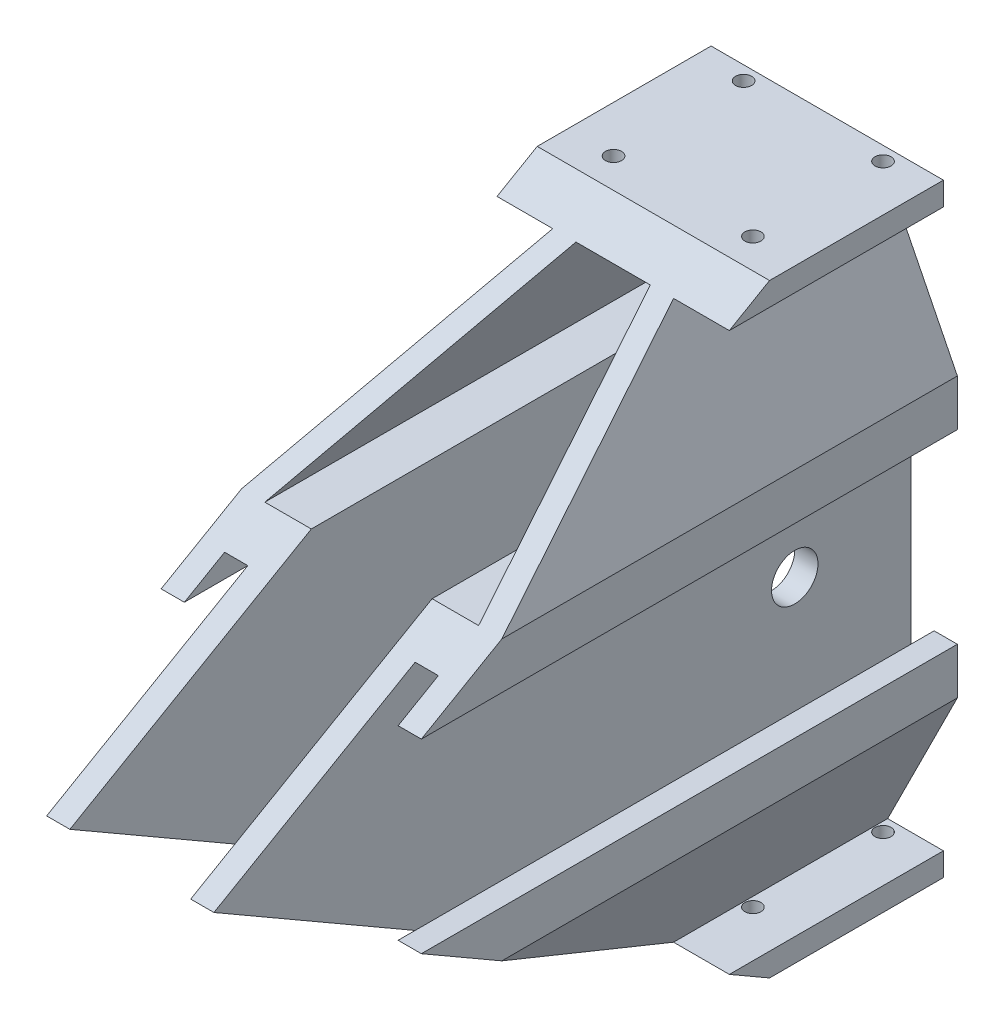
ISO-10303-21;
HEADER;
FILE_DESCRIPTION(('STEP AP214'),'2;1');
FILE_NAME('part.step','',(''),(''),'','','');
FILE_SCHEMA(('AUTOMOTIVE_DESIGN { 1 0 10303 214 1 1 1 1 }'));
ENDSEC;
DATA;
#1=APPLICATION_CONTEXT('core data for automotive mechanical design processes');
#2=APPLICATION_PROTOCOL_DEFINITION('international standard','automotive_design',2000,#1);
#3=PRODUCT_CONTEXT('',#1,'mechanical');
#4=PRODUCT('Part','Part','',(#3));
#5=PRODUCT_RELATED_PRODUCT_CATEGORY('part','',(#4));
#6=PRODUCT_DEFINITION_FORMATION('','',#4);
#7=PRODUCT_DEFINITION_CONTEXT('part definition',#1,'design');
#8=PRODUCT_DEFINITION('design','',#6,#7);
#9=PRODUCT_DEFINITION_SHAPE('','',#8);
#10=(LENGTH_UNIT() NAMED_UNIT(*) SI_UNIT(.MILLI.,.METRE.));
#11=(NAMED_UNIT(*) PLANE_ANGLE_UNIT() SI_UNIT($,.RADIAN.));
#12=(NAMED_UNIT(*) SI_UNIT($,.STERADIAN.) SOLID_ANGLE_UNIT());
#13=UNCERTAINTY_MEASURE_WITH_UNIT(LENGTH_MEASURE(1.E-05),#10,'distance_accuracy_value','');
#14=(GEOMETRIC_REPRESENTATION_CONTEXT(3) GLOBAL_UNCERTAINTY_ASSIGNED_CONTEXT((#13)) GLOBAL_UNIT_ASSIGNED_CONTEXT((#10,
#11,#12)) REPRESENTATION_CONTEXT('',''));
#15=CARTESIAN_POINT('',(0.,0.,0.));
#16=DIRECTION('',(0.,0.,1.));
#17=DIRECTION('',(1.,0.,0.));
#18=AXIS2_PLACEMENT_3D('',#15,#16,#17);
#19=CARTESIAN_POINT('',(18.,25.,-150.));
#20=DIRECTION('',(1.,0.,0.));
#21=DIRECTION('',(0.,0.,-1.));
#22=AXIS2_PLACEMENT_3D('',#19,#20,#21);
#23=PLANE('',#22);
#24=CARTESIAN_POINT('',(18.,0.,-125.));
#25=DIRECTION('',(1.,0.,0.));
#26=DIRECTION('',(0.,0.,-1.));
#27=AXIS2_PLACEMENT_3D('',#24,#25,#26);
#28=CIRCLE('',#27,4.99999999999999);
#29=CARTESIAN_POINT('',(18.,0.,-130.));
#30=VERTEX_POINT('',#29);
#31=EDGE_CURVE('E365',#30,#30,#28,.T.);
#32=ORIENTED_EDGE('',*,*,#31,.F.);
#33=EDGE_LOOP('',(#32));
#34=FACE_BOUND('',#33,.T.);
#35=DIRECTION('',(0.,0.499999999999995,-0.866025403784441));
#36=VECTOR('',#35,1.);
#37=CARTESIAN_POINT('',(18.,71.2019052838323,-123.325317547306));
#38=LINE('',#37,#36);
#39=CARTESIAN_POINT('',(18.,0.,0.));
#40=VERTEX_POINT('',#39);
#41=CARTESIAN_POINT('',(18.,25.,-43.3012701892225));
#42=VERTEX_POINT('',#41);
#43=EDGE_CURVE('E644',#40,#42,#38,.T.);
#44=ORIENTED_EDGE('',*,*,#43,.F.);
#45=DIRECTION('',(0.,-0.499999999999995,-0.866025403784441));
#46=VECTOR('',#45,1.);
#47=CARTESIAN_POINT('',(18.,-58.7019052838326,-101.674682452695));
#48=LINE('',#47,#46);
#49=CARTESIAN_POINT('',(18.,-25.,-43.3012701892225));
#50=VERTEX_POINT('',#49);
#51=EDGE_CURVE('E711',#40,#50,#48,.T.);
#52=ORIENTED_EDGE('',*,*,#51,.T.);
#53=DIRECTION('',(0.,0.,1.));
#54=VECTOR('',#53,1.);
#55=CARTESIAN_POINT('',(18.,-25.,-150.));
#56=LINE('',#55,#54);
#57=CARTESIAN_POINT('',(18.,-25.,-150.));
#58=VERTEX_POINT('',#57);
#59=EDGE_CURVE('E535',#58,#50,#56,.T.);
#60=ORIENTED_EDGE('',*,*,#59,.F.);
#61=DIRECTION('',(0.,1.,0.));
#62=VECTOR('',#61,1.);
#63=CARTESIAN_POINT('',(18.,25.,-150.));
#64=LINE('',#63,#62);
#65=CARTESIAN_POINT('',(18.,25.,-150.));
#66=VERTEX_POINT('',#65);
#67=EDGE_CURVE('E529',#58,#66,#64,.T.);
#68=ORIENTED_EDGE('',*,*,#67,.T.);
#69=DIRECTION('',(0.,0.,1.));
#70=VECTOR('',#69,1.);
#71=CARTESIAN_POINT('',(18.,25.,-150.));
#72=LINE('',#71,#70);
#73=EDGE_CURVE('E42',#66,#42,#72,.T.);
#74=ORIENTED_EDGE('',*,*,#73,.T.);
#75=EDGE_LOOP('',(#44,#52,#60,#68,#74));
#76=FACE_BOUND('',#75,.T.);
#77=ADVANCED_FACE('F34',(#34,#76),#23,.T.);
#78=CARTESIAN_POINT('',(18.,-25.,-150.));
#79=DIRECTION('',(0.,1.,0.));
#80=DIRECTION('',(-1.,0.,0.));
#81=AXIS2_PLACEMENT_3D('',#78,#79,#80);
#82=PLANE('',#81);
#83=ORIENTED_EDGE('',*,*,#59,.T.);
#84=DIRECTION('',(1.,0.,0.));
#85=VECTOR('',#84,1.);
#86=CARTESIAN_POINT('',(17.9999999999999,-25.,-43.3012701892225));
#87=LINE('',#86,#85);
#88=CARTESIAN_POINT('',(23.,-25.,-43.3012701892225));
#89=VERTEX_POINT('',#88);
#90=EDGE_CURVE('E715',#50,#89,#87,.T.);
#91=ORIENTED_EDGE('',*,*,#90,.T.);
#92=DIRECTION('',(0.,0.,1.));
#93=VECTOR('',#92,1.);
#94=CARTESIAN_POINT('',(23.,-25.,-150.));
#95=LINE('',#94,#93);
#96=CARTESIAN_POINT('',(23.,-25.,-150.));
#97=VERTEX_POINT('',#96);
#98=EDGE_CURVE('E538',#97,#89,#95,.T.);
#99=ORIENTED_EDGE('',*,*,#98,.F.);
#100=DIRECTION('',(-1.,0.,0.));
#101=VECTOR('',#100,1.);
#102=CARTESIAN_POINT('',(18.,-25.,-150.));
#103=LINE('',#102,#101);
#104=EDGE_CURVE('E526',#97,#58,#103,.T.);
#105=ORIENTED_EDGE('',*,*,#104,.T.);
#106=EDGE_LOOP('',(#83,#91,#99,#105));
#107=FACE_BOUND('',#106,.T.);
#108=ADVANCED_FACE('F841',(#107),#82,.T.);
#109=CARTESIAN_POINT('',(23.,-25.,-150.));
#110=DIRECTION('',(-1.,0.,0.));
#111=DIRECTION('',(0.,-1.,0.));
#112=AXIS2_PLACEMENT_3D('',#109,#110,#111);
#113=PLANE('',#112);
#114=ORIENTED_EDGE('',*,*,#98,.T.);
#115=DIRECTION('',(0.,0.499999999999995,0.866025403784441));
#116=VECTOR('',#115,1.);
#117=CARTESIAN_POINT('',(23.0000000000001,-71.2019052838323,-123.325317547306));
#118=LINE('',#117,#116);
#119=CARTESIAN_POINT('',(23.,-20.,-34.641016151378));
#120=VERTEX_POINT('',#119);
#121=EDGE_CURVE('E765',#89,#120,#118,.T.);
#122=ORIENTED_EDGE('',*,*,#121,.T.);
#123=DIRECTION('',(0.,0.,1.));
#124=VECTOR('',#123,1.);
#125=CARTESIAN_POINT('',(23.,-20.,-150.));
#126=LINE('',#125,#124);
#127=CARTESIAN_POINT('',(23.,-20.,-150.));
#128=VERTEX_POINT('',#127);
#129=EDGE_CURVE('E541',#128,#120,#126,.T.);
#130=ORIENTED_EDGE('',*,*,#129,.F.);
#131=DIRECTION('',(0.,-1.,0.));
#132=VECTOR('',#131,1.);
#133=CARTESIAN_POINT('',(23.,-25.,-150.));
#134=LINE('',#133,#132);
#135=EDGE_CURVE('E523',#128,#97,#134,.T.);
#136=ORIENTED_EDGE('',*,*,#135,.T.);
#137=EDGE_LOOP('',(#114,#122,#130,#136));
#138=FACE_BOUND('',#137,.T.);
#139=ADVANCED_FACE('F763',(#138),#113,.T.);
#140=CARTESIAN_POINT('',(23.,-20.,-150.));
#141=DIRECTION('',(0.,1.,0.));
#142=DIRECTION('',(0.,0.,1.));
#143=AXIS2_PLACEMENT_3D('',#140,#141,#142);
#144=PLANE('',#143);
#145=ORIENTED_EDGE('',*,*,#129,.T.);
#146=DIRECTION('',(1.,0.,0.));
#147=VECTOR('',#146,1.);
#148=CARTESIAN_POINT('',(23.,-20.,-34.641016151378));
#149=LINE('',#148,#147);
#150=CARTESIAN_POINT('',(28.,-20.,-34.641016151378));
#151=VERTEX_POINT('',#150);
#152=EDGE_CURVE('E769',#120,#151,#149,.T.);
#153=ORIENTED_EDGE('',*,*,#152,.T.);
#154=DIRECTION('',(0.,0.,1.));
#155=VECTOR('',#154,1.);
#156=CARTESIAN_POINT('',(28.,-20.,-150.));
#157=LINE('',#156,#155);
#158=CARTESIAN_POINT('',(28.,-20.,-150.));
#159=VERTEX_POINT('',#158);
#160=EDGE_CURVE('E544',#159,#151,#157,.T.);
#161=ORIENTED_EDGE('',*,*,#160,.F.);
#162=DIRECTION('',(-1.,0.,0.));
#163=VECTOR('',#162,1.);
#164=CARTESIAN_POINT('',(23.,-20.,-150.));
#165=LINE('',#164,#163);
#166=EDGE_CURVE('E520',#159,#128,#165,.T.);
#167=ORIENTED_EDGE('',*,*,#166,.T.);
#168=EDGE_LOOP('',(#145,#153,#161,#167));
#169=FACE_BOUND('',#168,.T.);
#170=ADVANCED_FACE('F768',(#169),#144,.T.);
#171=CARTESIAN_POINT('',(28.,-20.,-150.));
#172=DIRECTION('',(1.,0.,0.));
#173=DIRECTION('',(0.,1.,0.));
#174=AXIS2_PLACEMENT_3D('',#171,#172,#173);
#175=PLANE('',#174);
#176=ORIENTED_EDGE('',*,*,#160,.T.);
#177=DIRECTION('',(0.,-0.499999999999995,-0.866025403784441));
#178=VECTOR('',#177,1.);
#179=CARTESIAN_POINT('',(28.,0.,0.));
#180=LINE('',#179,#178);
#181=CARTESIAN_POINT('',(28.,-30.,-51.961524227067));
#182=VERTEX_POINT('',#181);
#183=EDGE_CURVE('E775',#151,#182,#180,.T.);
#184=ORIENTED_EDGE('',*,*,#183,.T.);
#185=DIRECTION('',(0.,0.,1.));
#186=VECTOR('',#185,1.);
#187=CARTESIAN_POINT('',(28.,-30.,-150.));
#188=LINE('',#187,#186);
#189=CARTESIAN_POINT('',(28.,-30.,-150.));
#190=VERTEX_POINT('',#189);
#191=EDGE_CURVE('E547',#190,#182,#188,.T.);
#192=ORIENTED_EDGE('',*,*,#191,.F.);
#193=DIRECTION('',(0.,1.,0.));
#194=VECTOR('',#193,1.);
#195=CARTESIAN_POINT('',(28.,-20.,-150.));
#196=LINE('',#195,#194);
#197=EDGE_CURVE('E517',#190,#159,#196,.T.);
#198=ORIENTED_EDGE('',*,*,#197,.T.);
#199=EDGE_LOOP('',(#176,#184,#192,#198));
#200=FACE_BOUND('',#199,.T.);
#201=ADVANCED_FACE('F773',(#200),#175,.T.);
#202=CARTESIAN_POINT('',(28.,-30.,-150.));
#203=DIRECTION('',(0.894427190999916,-0.447213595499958,0.));
#204=DIRECTION('',(0.447213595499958,0.894427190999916,0.));
#205=AXIS2_PLACEMENT_3D('',#202,#203,#204);
#206=PLANE('',#205);
#207=ORIENTED_EDGE('',*,*,#191,.T.);
#208=DIRECTION('',(-0.242535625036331,-0.485071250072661,-0.840168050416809));
#209=VECTOR('',#208,1.);
#210=CARTESIAN_POINT('',(8.02263280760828,-69.9547343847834,-121.165154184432));
#211=LINE('',#210,#209);
#212=CARTESIAN_POINT('',(13.,-60.,-103.923048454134));
#213=VERTEX_POINT('',#212);
#214=EDGE_CURVE('E779',#182,#213,#211,.T.);
#215=ORIENTED_EDGE('',*,*,#214,.T.);
#216=DIRECTION('',(0.,0.,1.));
#217=VECTOR('',#216,1.);
#218=CARTESIAN_POINT('',(13.,-60.,-150.));
#219=LINE('',#218,#217);
#220=CARTESIAN_POINT('',(13.,-60.,-150.));
#221=VERTEX_POINT('',#220);
#222=EDGE_CURVE('E550',#221,#213,#219,.T.);
#223=ORIENTED_EDGE('',*,*,#222,.F.);
#224=DIRECTION('',(0.447213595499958,0.894427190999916,0.));
#225=VECTOR('',#224,1.);
#226=CARTESIAN_POINT('',(28.,-30.,-150.));
#227=LINE('',#226,#225);
#228=EDGE_CURVE('E514',#221,#190,#227,.T.);
#229=ORIENTED_EDGE('',*,*,#228,.T.);
#230=EDGE_LOOP('',(#207,#215,#223,#229));
#231=FACE_BOUND('',#230,.T.);
#232=ADVANCED_FACE('F778',(#231),#206,.T.);
#233=CARTESIAN_POINT('',(25.,-60.,-150.));
#234=DIRECTION('',(0.,1.,0.));
#235=DIRECTION('',(0.,0.,1.));
#236=AXIS2_PLACEMENT_3D('',#233,#234,#235);
#237=PLANE('',#236);
#238=CARTESIAN_POINT('',(15.,-60.,-147.));
#239=DIRECTION('',(0.,-1.,0.));
#240=DIRECTION('',(0.,0.,-1.));
#241=AXIS2_PLACEMENT_3D('',#238,#239,#240);
#242=CIRCLE('',#241,1.7272);
#243=CARTESIAN_POINT('',(15.,-60.,-148.7272));
#244=VERTEX_POINT('',#243);
#245=EDGE_CURVE('E1402',#244,#244,#242,.T.);
#246=ORIENTED_EDGE('',*,*,#245,.T.);
#247=EDGE_LOOP('',(#246));
#248=FACE_BOUND('',#247,.T.);
#249=CARTESIAN_POINT('',(15.,-60.,-119.));
#250=DIRECTION('',(0.,-1.,0.));
#251=DIRECTION('',(0.,0.,-1.));
#252=AXIS2_PLACEMENT_3D('',#249,#250,#251);
#253=CIRCLE('',#252,1.7272);
#254=CARTESIAN_POINT('',(15.,-60.,-120.7272));
#255=VERTEX_POINT('',#254);
#256=EDGE_CURVE('E1414',#255,#255,#253,.T.);
#257=ORIENTED_EDGE('',*,*,#256,.T.);
#258=EDGE_LOOP('',(#257));
#259=FACE_BOUND('',#258,.T.);
#260=ORIENTED_EDGE('',*,*,#222,.T.);
#261=DIRECTION('',(1.,0.,0.));
#262=VECTOR('',#261,1.);
#263=CARTESIAN_POINT('',(25.,-60.,-103.923048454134));
#264=LINE('',#263,#262);
#265=CARTESIAN_POINT('',(25.,-60.,-103.923048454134));
#266=VERTEX_POINT('',#265);
#267=EDGE_CURVE('E785',#213,#266,#264,.T.);
#268=ORIENTED_EDGE('',*,*,#267,.T.);
#269=DIRECTION('',(0.,0.,1.));
#270=VECTOR('',#269,1.);
#271=CARTESIAN_POINT('',(25.,-60.,-150.));
#272=LINE('',#271,#270);
#273=CARTESIAN_POINT('',(25.,-60.,-150.));
#274=VERTEX_POINT('',#273);
#275=EDGE_CURVE('E553',#274,#266,#272,.T.);
#276=ORIENTED_EDGE('',*,*,#275,.F.);
#277=DIRECTION('',(-1.,0.,0.));
#278=VECTOR('',#277,1.);
#279=CARTESIAN_POINT('',(25.,-60.,-150.));
#280=LINE('',#279,#278);
#281=EDGE_CURVE('E511',#274,#221,#280,.T.);
#282=ORIENTED_EDGE('',*,*,#281,.T.);
#283=EDGE_LOOP('',(#260,#268,#276,#282));
#284=FACE_BOUND('',#283,.T.);
#285=ADVANCED_FACE('F783',(#248,#259,#284),#237,.T.);
#286=CARTESIAN_POINT('',(25.,-65.,-150.));
#287=DIRECTION('',(1.,0.,0.));
#288=DIRECTION('',(0.,0.,-1.));
#289=AXIS2_PLACEMENT_3D('',#286,#287,#288);
#290=PLANE('',#289);
#291=ORIENTED_EDGE('',*,*,#275,.T.);
#292=DIRECTION('',(0.,-0.499999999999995,-0.866025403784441));
#293=VECTOR('',#292,1.);
#294=CARTESIAN_POINT('',(25.,-81.2019052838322,-140.645825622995));
#295=LINE('',#294,#293);
#296=CARTESIAN_POINT('',(25.,-65.,-112.583302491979));
#297=VERTEX_POINT('',#296);
#298=EDGE_CURVE('E789',#266,#297,#295,.T.);
#299=ORIENTED_EDGE('',*,*,#298,.T.);
#300=DIRECTION('',(0.,0.,1.));
#301=VECTOR('',#300,1.);
#302=CARTESIAN_POINT('',(25.,-65.,-150.));
#303=LINE('',#302,#301);
#304=CARTESIAN_POINT('',(25.,-65.,-150.));
#305=VERTEX_POINT('',#304);
#306=EDGE_CURVE('E556',#305,#297,#303,.T.);
#307=ORIENTED_EDGE('',*,*,#306,.F.);
#308=DIRECTION('',(0.,1.,0.));
#309=VECTOR('',#308,1.);
#310=CARTESIAN_POINT('',(25.,-65.,-150.));
#311=LINE('',#310,#309);
#312=EDGE_CURVE('E508',#305,#274,#311,.T.);
#313=ORIENTED_EDGE('',*,*,#312,.T.);
#314=EDGE_LOOP('',(#291,#299,#307,#313));
#315=FACE_BOUND('',#314,.T.);
#316=ADVANCED_FACE('F788',(#315),#290,.T.);
#317=CARTESIAN_POINT('',(-25.,-65.,-150.));
#318=DIRECTION('',(0.,-1.,0.));
#319=DIRECTION('',(0.,0.,-1.));
#320=AXIS2_PLACEMENT_3D('',#317,#318,#319);
#321=PLANE('',#320);
#322=CARTESIAN_POINT('',(-15.,-65.,-147.));
#323=DIRECTION('',(0.,-1.,0.));
#324=DIRECTION('',(0.,0.,-1.));
#325=AXIS2_PLACEMENT_3D('',#322,#323,#324);
#326=CIRCLE('',#325,1.7272);
#327=CARTESIAN_POINT('',(-15.,-65.,-148.7272));
#328=VERTEX_POINT('',#327);
#329=EDGE_CURVE('E1395',#328,#328,#326,.T.);
#330=ORIENTED_EDGE('',*,*,#329,.F.);
#331=EDGE_LOOP('',(#330));
#332=FACE_BOUND('',#331,.T.);
#333=CARTESIAN_POINT('',(15.,-65.,-147.));
#334=DIRECTION('',(0.,-1.,0.));
#335=DIRECTION('',(0.,0.,-1.));
#336=AXIS2_PLACEMENT_3D('',#333,#334,#335);
#337=CIRCLE('',#336,1.7272);
#338=CARTESIAN_POINT('',(15.,-65.,-148.7272));
#339=VERTEX_POINT('',#338);
#340=EDGE_CURVE('E1397',#339,#339,#337,.T.);
#341=ORIENTED_EDGE('',*,*,#340,.F.);
#342=EDGE_LOOP('',(#341));
#343=FACE_BOUND('',#342,.T.);
#344=CARTESIAN_POINT('',(-15.,-65.,-119.));
#345=DIRECTION('',(0.,-1.,0.));
#346=DIRECTION('',(0.,0.,-1.));
#347=AXIS2_PLACEMENT_3D('',#344,#345,#346);
#348=CIRCLE('',#347,1.7272);
#349=CARTESIAN_POINT('',(-15.,-65.,-120.7272));
#350=VERTEX_POINT('',#349);
#351=EDGE_CURVE('E1405',#350,#350,#348,.T.);
#352=ORIENTED_EDGE('',*,*,#351,.F.);
#353=EDGE_LOOP('',(#352));
#354=FACE_BOUND('',#353,.T.);
#355=CARTESIAN_POINT('',(15.,-65.,-119.));
#356=DIRECTION('',(0.,-1.,0.));
#357=DIRECTION('',(0.,0.,-1.));
#358=AXIS2_PLACEMENT_3D('',#355,#356,#357);
#359=CIRCLE('',#358,1.7272);
#360=CARTESIAN_POINT('',(15.,-65.,-120.7272));
#361=VERTEX_POINT('',#360);
#362=EDGE_CURVE('E1411',#361,#361,#359,.T.);
#363=ORIENTED_EDGE('',*,*,#362,.F.);
#364=EDGE_LOOP('',(#363));
#365=FACE_BOUND('',#364,.T.);
#366=ORIENTED_EDGE('',*,*,#306,.T.);
#367=DIRECTION('',(1.,0.,0.));
#368=VECTOR('',#367,1.);
#369=CARTESIAN_POINT('',(-28.,-65.,-112.583302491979));
#370=LINE('',#369,#368);
#371=CARTESIAN_POINT('',(-25.,-65.,-112.583302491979));
#372=VERTEX_POINT('',#371);
#373=EDGE_CURVE('E795',#372,#297,#370,.T.);
#374=ORIENTED_EDGE('',*,*,#373,.F.);
#375=DIRECTION('',(0.,0.,1.));
#376=VECTOR('',#375,1.);
#377=CARTESIAN_POINT('',(-25.,-65.,-150.));
#378=LINE('',#377,#376);
#379=CARTESIAN_POINT('',(-25.,-65.,-150.));
#380=VERTEX_POINT('',#379);
#381=EDGE_CURVE('E559',#380,#372,#378,.T.);
#382=ORIENTED_EDGE('',*,*,#381,.F.);
#383=DIRECTION('',(1.,0.,0.));
#384=VECTOR('',#383,1.);
#385=CARTESIAN_POINT('',(-25.,-65.,-150.));
#386=LINE('',#385,#384);
#387=EDGE_CURVE('E505',#380,#305,#386,.T.);
#388=ORIENTED_EDGE('',*,*,#387,.T.);
#389=EDGE_LOOP('',(#366,#374,#382,#388));
#390=FACE_BOUND('',#389,.T.);
#391=ADVANCED_FACE('F793',(#332,#343,#354,#365,#390),#321,.T.);
#392=CARTESIAN_POINT('',(-25.,-60.,-150.));
#393=DIRECTION('',(-1.,0.,0.));
#394=DIRECTION('',(0.,0.,1.));
#395=AXIS2_PLACEMENT_3D('',#392,#393,#394);
#396=PLANE('',#395);
#397=ORIENTED_EDGE('',*,*,#381,.T.);
#398=DIRECTION('',(0.,0.499999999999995,0.866025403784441));
#399=VECTOR('',#398,1.);
#400=CARTESIAN_POINT('',(-25.,-79.9519052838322,-138.480762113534));
#401=LINE('',#400,#399);
#402=CARTESIAN_POINT('',(-25.,-60.,-103.923048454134));
#403=VERTEX_POINT('',#402);
#404=EDGE_CURVE('E799',#372,#403,#401,.T.);
#405=ORIENTED_EDGE('',*,*,#404,.T.);
#406=DIRECTION('',(0.,0.,1.));
#407=VECTOR('',#406,1.);
#408=CARTESIAN_POINT('',(-25.,-60.,-150.));
#409=LINE('',#408,#407);
#410=CARTESIAN_POINT('',(-25.,-60.,-150.));
#411=VERTEX_POINT('',#410);
#412=EDGE_CURVE('E562',#411,#403,#409,.T.);
#413=ORIENTED_EDGE('',*,*,#412,.F.);
#414=DIRECTION('',(0.,-1.,0.));
#415=VECTOR('',#414,1.);
#416=CARTESIAN_POINT('',(-25.,-60.,-150.));
#417=LINE('',#416,#415);
#418=EDGE_CURVE('E502',#411,#380,#417,.T.);
#419=ORIENTED_EDGE('',*,*,#418,.T.);
#420=EDGE_LOOP('',(#397,#405,#413,#419));
#421=FACE_BOUND('',#420,.T.);
#422=ADVANCED_FACE('F798',(#421),#396,.T.);
#423=CARTESIAN_POINT('',(-13.,-60.,-150.));
#424=DIRECTION('',(0.,1.,0.));
#425=DIRECTION('',(0.,0.,1.));
#426=AXIS2_PLACEMENT_3D('',#423,#424,#425);
#427=PLANE('',#426);
#428=CARTESIAN_POINT('',(-15.,-60.,-147.));
#429=DIRECTION('',(0.,-1.,0.));
#430=DIRECTION('',(0.,0.,-1.));
#431=AXIS2_PLACEMENT_3D('',#428,#429,#430);
#432=CIRCLE('',#431,1.7272);
#433=CARTESIAN_POINT('',(-15.,-60.,-148.7272));
#434=VERTEX_POINT('',#433);
#435=EDGE_CURVE('E1392',#434,#434,#432,.T.);
#436=ORIENTED_EDGE('',*,*,#435,.T.);
#437=EDGE_LOOP('',(#436));
#438=FACE_BOUND('',#437,.T.);
#439=CARTESIAN_POINT('',(-15.,-60.,-119.));
#440=DIRECTION('',(0.,-1.,0.));
#441=DIRECTION('',(0.,0.,-1.));
#442=AXIS2_PLACEMENT_3D('',#439,#440,#441);
#443=CIRCLE('',#442,1.7272);
#444=CARTESIAN_POINT('',(-15.,-60.,-120.7272));
#445=VERTEX_POINT('',#444);
#446=EDGE_CURVE('E1408',#445,#445,#443,.T.);
#447=ORIENTED_EDGE('',*,*,#446,.T.);
#448=EDGE_LOOP('',(#447));
#449=FACE_BOUND('',#448,.T.);
#450=ORIENTED_EDGE('',*,*,#412,.T.);
#451=DIRECTION('',(1.,0.,0.));
#452=VECTOR('',#451,1.);
#453=CARTESIAN_POINT('',(-13.,-60.,-103.923048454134));
#454=LINE('',#453,#452);
#455=CARTESIAN_POINT('',(-13.,-60.,-103.923048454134));
#456=VERTEX_POINT('',#455);
#457=EDGE_CURVE('E805',#403,#456,#454,.T.);
#458=ORIENTED_EDGE('',*,*,#457,.T.);
#459=DIRECTION('',(0.,0.,1.));
#460=VECTOR('',#459,1.);
#461=CARTESIAN_POINT('',(-13.,-60.,-150.));
#462=LINE('',#461,#460);
#463=CARTESIAN_POINT('',(-13.,-60.,-150.));
#464=VERTEX_POINT('',#463);
#465=EDGE_CURVE('E565',#464,#456,#462,.T.);
#466=ORIENTED_EDGE('',*,*,#465,.F.);
#467=DIRECTION('',(-1.,0.,0.));
#468=VECTOR('',#467,1.);
#469=CARTESIAN_POINT('',(-13.,-60.,-150.));
#470=LINE('',#469,#468);
#471=EDGE_CURVE('E499',#464,#411,#470,.T.);
#472=ORIENTED_EDGE('',*,*,#471,.T.);
#473=EDGE_LOOP('',(#450,#458,#466,#472));
#474=FACE_BOUND('',#473,.T.);
#475=ADVANCED_FACE('F803',(#438,#449,#474),#427,.T.);
#476=CARTESIAN_POINT('',(-28.,-30.,-150.));
#477=DIRECTION('',(-0.894427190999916,-0.447213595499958,0.));
#478=DIRECTION('',(0.447213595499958,-0.894427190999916,0.));
#479=AXIS2_PLACEMENT_3D('',#476,#477,#478);
#480=PLANE('',#479);
#481=ORIENTED_EDGE('',*,*,#465,.T.);
#482=DIRECTION('',(-0.242535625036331,0.485071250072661,0.840168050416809));
#483=VECTOR('',#482,1.);
#484=CARTESIAN_POINT('',(-8.02263280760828,-69.9547343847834,-121.165154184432));
#485=LINE('',#484,#483);
#486=CARTESIAN_POINT('',(-28.,-30.,-51.961524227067));
#487=VERTEX_POINT('',#486);
#488=EDGE_CURVE('E809',#456,#487,#485,.T.);
#489=ORIENTED_EDGE('',*,*,#488,.T.);
#490=DIRECTION('',(0.,0.,1.));
#491=VECTOR('',#490,1.);
#492=CARTESIAN_POINT('',(-28.,-30.,-150.));
#493=LINE('',#492,#491);
#494=CARTESIAN_POINT('',(-28.,-30.,-150.));
#495=VERTEX_POINT('',#494);
#496=EDGE_CURVE('E568',#495,#487,#493,.T.);
#497=ORIENTED_EDGE('',*,*,#496,.F.);
#498=DIRECTION('',(0.447213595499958,-0.894427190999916,0.));
#499=VECTOR('',#498,1.);
#500=CARTESIAN_POINT('',(-28.,-30.,-150.));
#501=LINE('',#500,#499);
#502=EDGE_CURVE('E496',#495,#464,#501,.T.);
#503=ORIENTED_EDGE('',*,*,#502,.T.);
#504=EDGE_LOOP('',(#481,#489,#497,#503));
#505=FACE_BOUND('',#504,.T.);
#506=ADVANCED_FACE('F808',(#505),#480,.T.);
#507=CARTESIAN_POINT('',(-28.,-20.,-150.));
#508=DIRECTION('',(-1.,0.,0.));
#509=DIRECTION('',(0.,-1.,0.));
#510=AXIS2_PLACEMENT_3D('',#507,#508,#509);
#511=PLANE('',#510);
#512=ORIENTED_EDGE('',*,*,#496,.T.);
#513=DIRECTION('',(0.,-0.499999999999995,-0.866025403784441));
#514=VECTOR('',#513,1.);
#515=CARTESIAN_POINT('',(-28.,0.,0.));
#516=LINE('',#515,#514);
#517=CARTESIAN_POINT('',(-28.,-20.,-34.641016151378));
#518=VERTEX_POINT('',#517);
#519=EDGE_CURVE('E815',#518,#487,#516,.T.);
#520=ORIENTED_EDGE('',*,*,#519,.F.);
#521=DIRECTION('',(0.,0.,1.));
#522=VECTOR('',#521,1.);
#523=CARTESIAN_POINT('',(-28.,-20.,-150.));
#524=LINE('',#523,#522);
#525=CARTESIAN_POINT('',(-28.,-20.,-150.));
#526=VERTEX_POINT('',#525);
#527=EDGE_CURVE('E571',#526,#518,#524,.T.);
#528=ORIENTED_EDGE('',*,*,#527,.F.);
#529=DIRECTION('',(0.,-1.,0.));
#530=VECTOR('',#529,1.);
#531=CARTESIAN_POINT('',(-28.,-20.,-150.));
#532=LINE('',#531,#530);
#533=EDGE_CURVE('E493',#526,#495,#532,.T.);
#534=ORIENTED_EDGE('',*,*,#533,.T.);
#535=EDGE_LOOP('',(#512,#520,#528,#534));
#536=FACE_BOUND('',#535,.T.);
#537=ADVANCED_FACE('F813',(#536),#511,.T.);
#538=CARTESIAN_POINT('',(-23.,-20.,-150.));
#539=DIRECTION('',(0.,1.,0.));
#540=DIRECTION('',(0.,0.,1.));
#541=AXIS2_PLACEMENT_3D('',#538,#539,#540);
#542=PLANE('',#541);
#543=ORIENTED_EDGE('',*,*,#527,.T.);
#544=DIRECTION('',(1.,0.,0.));
#545=VECTOR('',#544,1.);
#546=CARTESIAN_POINT('',(-23.,-20.,-34.641016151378));
#547=LINE('',#546,#545);
#548=CARTESIAN_POINT('',(-23.,-20.,-34.641016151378));
#549=VERTEX_POINT('',#548);
#550=EDGE_CURVE('E819',#518,#549,#547,.T.);
#551=ORIENTED_EDGE('',*,*,#550,.T.);
#552=DIRECTION('',(0.,0.,1.));
#553=VECTOR('',#552,1.);
#554=CARTESIAN_POINT('',(-23.,-20.,-150.));
#555=LINE('',#554,#553);
#556=CARTESIAN_POINT('',(-23.,-20.,-150.));
#557=VERTEX_POINT('',#556);
#558=EDGE_CURVE('E574',#557,#549,#555,.T.);
#559=ORIENTED_EDGE('',*,*,#558,.F.);
#560=DIRECTION('',(-1.,0.,0.));
#561=VECTOR('',#560,1.);
#562=CARTESIAN_POINT('',(-23.,-20.,-150.));
#563=LINE('',#562,#561);
#564=EDGE_CURVE('E490',#557,#526,#563,.T.);
#565=ORIENTED_EDGE('',*,*,#564,.T.);
#566=EDGE_LOOP('',(#543,#551,#559,#565));
#567=FACE_BOUND('',#566,.T.);
#568=ADVANCED_FACE('F818',(#567),#542,.T.);
#569=CARTESIAN_POINT('',(-23.,-25.,-150.));
#570=DIRECTION('',(1.,0.,0.));
#571=DIRECTION('',(0.,1.,0.));
#572=AXIS2_PLACEMENT_3D('',#569,#570,#571);
#573=PLANE('',#572);
#574=ORIENTED_EDGE('',*,*,#558,.T.);
#575=DIRECTION('',(0.,-0.499999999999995,-0.866025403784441));
#576=VECTOR('',#575,1.);
#577=CARTESIAN_POINT('',(-23.0000000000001,-71.2019052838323,-123.325317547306));
#578=LINE('',#577,#576);
#579=CARTESIAN_POINT('',(-23.,-25.,-43.3012701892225));
#580=VERTEX_POINT('',#579);
#581=EDGE_CURVE('E825',#549,#580,#578,.T.);
#582=ORIENTED_EDGE('',*,*,#581,.T.);
#583=DIRECTION('',(0.,0.,1.));
#584=VECTOR('',#583,1.);
#585=CARTESIAN_POINT('',(-23.,-25.,-150.));
#586=LINE('',#585,#584);
#587=CARTESIAN_POINT('',(-23.,-25.,-150.));
#588=VERTEX_POINT('',#587);
#589=EDGE_CURVE('E577',#588,#580,#586,.T.);
#590=ORIENTED_EDGE('',*,*,#589,.F.);
#591=DIRECTION('',(0.,1.,0.));
#592=VECTOR('',#591,1.);
#593=CARTESIAN_POINT('',(-23.,-25.,-150.));
#594=LINE('',#593,#592);
#595=EDGE_CURVE('E487',#588,#557,#594,.T.);
#596=ORIENTED_EDGE('',*,*,#595,.T.);
#597=EDGE_LOOP('',(#574,#582,#590,#596));
#598=FACE_BOUND('',#597,.T.);
#599=ADVANCED_FACE('F823',(#598),#573,.T.);
#600=CARTESIAN_POINT('',(-18.,-25.,-150.));
#601=DIRECTION('',(0.,1.,0.));
#602=DIRECTION('',(-1.,0.,0.));
#603=AXIS2_PLACEMENT_3D('',#600,#601,#602);
#604=PLANE('',#603);
#605=ORIENTED_EDGE('',*,*,#589,.T.);
#606=DIRECTION('',(1.,0.,0.));
#607=VECTOR('',#606,1.);
#608=CARTESIAN_POINT('',(-17.9999999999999,-25.,-43.3012701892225));
#609=LINE('',#608,#607);
#610=CARTESIAN_POINT('',(-18.,-25.,-43.3012701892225));
#611=VERTEX_POINT('',#610);
#612=EDGE_CURVE('E347',#580,#611,#609,.T.);
#613=ORIENTED_EDGE('',*,*,#612,.T.);
#614=DIRECTION('',(0.,0.,1.));
#615=VECTOR('',#614,1.);
#616=CARTESIAN_POINT('',(-18.,-25.,-150.));
#617=LINE('',#616,#615);
#618=CARTESIAN_POINT('',(-18.,-25.,-150.));
#619=VERTEX_POINT('',#618);
#620=EDGE_CURVE('E346',#619,#611,#617,.T.);
#621=ORIENTED_EDGE('',*,*,#620,.F.);
#622=DIRECTION('',(-1.,0.,0.));
#623=VECTOR('',#622,1.);
#624=CARTESIAN_POINT('',(-18.,-25.,-150.));
#625=LINE('',#624,#623);
#626=EDGE_CURVE('E484',#619,#588,#625,.T.);
#627=ORIENTED_EDGE('',*,*,#626,.T.);
#628=EDGE_LOOP('',(#605,#613,#621,#627));
#629=FACE_BOUND('',#628,.T.);
#630=ADVANCED_FACE('F827',(#629),#604,.T.);
#631=CARTESIAN_POINT('',(-18.,25.,-150.));
#632=DIRECTION('',(-1.,0.,0.));
#633=DIRECTION('',(0.,0.,1.));
#634=AXIS2_PLACEMENT_3D('',#631,#632,#633);
#635=PLANE('',#634);
#636=CARTESIAN_POINT('',(-18.,0.,-125.));
#637=DIRECTION('',(-1.,0.,0.));
#638=DIRECTION('',(0.,0.,1.));
#639=AXIS2_PLACEMENT_3D('',#636,#637,#638);
#640=CIRCLE('',#639,4.99999999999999);
#641=CARTESIAN_POINT('',(-18.,0.,-120.));
#642=VERTEX_POINT('',#641);
#643=EDGE_CURVE('E362',#642,#642,#640,.T.);
#644=ORIENTED_EDGE('',*,*,#643,.F.);
#645=EDGE_LOOP('',(#644));
#646=FACE_BOUND('',#645,.T.);
#647=ORIENTED_EDGE('',*,*,#620,.T.);
#648=DIRECTION('',(0.,0.499999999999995,0.866025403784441));
#649=VECTOR('',#648,1.);
#650=CARTESIAN_POINT('',(-18.,-58.7019052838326,-101.674682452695));
#651=LINE('',#650,#649);
#652=CARTESIAN_POINT('',(-18.,0.,0.));
#653=VERTEX_POINT('',#652);
#654=EDGE_CURVE('E330',#611,#653,#651,.T.);
#655=ORIENTED_EDGE('',*,*,#654,.T.);
#656=DIRECTION('',(0.,-0.499999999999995,0.866025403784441));
#657=VECTOR('',#656,1.);
#658=CARTESIAN_POINT('',(-18.,71.2019052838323,-123.325317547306));
#659=LINE('',#658,#657);
#660=CARTESIAN_POINT('',(-18.,25.,-43.3012701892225));
#661=VERTEX_POINT('',#660);
#662=EDGE_CURVE('E343',#661,#653,#659,.T.);
#663=ORIENTED_EDGE('',*,*,#662,.F.);
#664=DIRECTION('',(0.,0.,1.));
#665=VECTOR('',#664,1.);
#666=CARTESIAN_POINT('',(-18.,25.,-150.));
#667=LINE('',#666,#665);
#668=CARTESIAN_POINT('',(-18.,25.,-150.));
#669=VERTEX_POINT('',#668);
#670=EDGE_CURVE('E581',#669,#661,#667,.T.);
#671=ORIENTED_EDGE('',*,*,#670,.F.);
#672=DIRECTION('',(0.,-1.,0.));
#673=VECTOR('',#672,1.);
#674=CARTESIAN_POINT('',(-18.,25.,-150.));
#675=LINE('',#674,#673);
#676=EDGE_CURVE('E482',#669,#619,#675,.T.);
#677=ORIENTED_EDGE('',*,*,#676,.T.);
#678=EDGE_LOOP('',(#647,#655,#663,#671,#677));
#679=FACE_BOUND('',#678,.T.);
#680=ADVANCED_FACE('F342',(#646,#679),#635,.T.);
#681=CARTESIAN_POINT('',(-13.,-30.,-150.));
#682=DIRECTION('',(0.,1.,0.));
#683=DIRECTION('',(-1.,0.,0.));
#684=AXIS2_PLACEMENT_3D('',#681,#682,#683);
#685=PLANE('',#684);
#686=DIRECTION('',(1.,0.,0.));
#687=VECTOR('',#686,1.);
#688=CARTESIAN_POINT('',(-12.9999999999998,-30.,-51.961524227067));
#689=LINE('',#688,#687);
#690=CARTESIAN_POINT('',(-23.,-30.,-51.961524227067));
#691=VERTEX_POINT('',#690);
#692=CARTESIAN_POINT('',(-13.,-30.,-51.961524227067));
#693=VERTEX_POINT('',#692);
#694=EDGE_CURVE('E860',#691,#693,#689,.T.);
#695=ORIENTED_EDGE('',*,*,#694,.F.);
#696=DIRECTION('',(0.,0.,1.));
#697=VECTOR('',#696,1.);
#698=CARTESIAN_POINT('',(-23.,-30.,-150.));
#699=LINE('',#698,#697);
#700=CARTESIAN_POINT('',(-23.,-30.,-150.));
#701=VERTEX_POINT('',#700);
#702=EDGE_CURVE('E402',#701,#691,#699,.T.);
#703=ORIENTED_EDGE('',*,*,#702,.F.);
#704=DIRECTION('',(-1.,0.,0.));
#705=VECTOR('',#704,1.);
#706=CARTESIAN_POINT('',(-13.,-30.,-150.));
#707=LINE('',#706,#705);
#708=CARTESIAN_POINT('',(-13.,-30.,-150.));
#709=VERTEX_POINT('',#708);
#710=EDGE_CURVE('E368',#709,#701,#707,.T.);
#711=ORIENTED_EDGE('',*,*,#710,.F.);
#712=DIRECTION('',(0.,0.,1.));
#713=VECTOR('',#712,1.);
#714=CARTESIAN_POINT('',(-13.,-30.,-150.));
#715=LINE('',#714,#713);
#716=EDGE_CURVE('E403',#709,#693,#715,.T.);
#717=ORIENTED_EDGE('',*,*,#716,.T.);
#718=EDGE_LOOP('',(#695,#703,#711,#717));
#719=FACE_BOUND('',#718,.T.);
#720=ADVANCED_FACE('F864',(#719),#685,.F.);
#721=CARTESIAN_POINT('',(-13.,30.,-150.));
#722=DIRECTION('',(-1.,0.,0.));
#723=DIRECTION('',(0.,0.,1.));
#724=AXIS2_PLACEMENT_3D('',#721,#722,#723);
#725=PLANE('',#724);
#726=CARTESIAN_POINT('',(-13.,0.,-125.));
#727=DIRECTION('',(-1.,0.,0.));
#728=DIRECTION('',(0.,0.,1.));
#729=AXIS2_PLACEMENT_3D('',#726,#727,#728);
#730=CIRCLE('',#729,4.99999999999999);
#731=CARTESIAN_POINT('',(-13.,0.,-120.));
#732=VERTEX_POINT('',#731);
#733=EDGE_CURVE('E355',#732,#732,#730,.T.);
#734=ORIENTED_EDGE('',*,*,#733,.T.);
#735=EDGE_LOOP('',(#734));
#736=FACE_BOUND('',#735,.T.);
#737=DIRECTION('',(0.,0.499999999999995,0.866025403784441));
#738=VECTOR('',#737,1.);
#739=CARTESIAN_POINT('',(-13.,-57.4519052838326,-99.5096189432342));
#740=LINE('',#739,#738);
#741=CARTESIAN_POINT('',(-13.,0.,0.));
#742=VERTEX_POINT('',#741);
#743=EDGE_CURVE('E333',#693,#742,#740,.T.);
#744=ORIENTED_EDGE('',*,*,#743,.F.);
#745=ORIENTED_EDGE('',*,*,#716,.F.);
#746=DIRECTION('',(0.,-1.,0.));
#747=VECTOR('',#746,1.);
#748=CARTESIAN_POINT('',(-13.,30.,-150.));
#749=LINE('',#748,#747);
#750=CARTESIAN_POINT('',(-13.,30.,-150.));
#751=VERTEX_POINT('',#750);
#752=EDGE_CURVE('E399',#751,#709,#749,.T.);
#753=ORIENTED_EDGE('',*,*,#752,.F.);
#754=DIRECTION('',(0.,0.,1.));
#755=VECTOR('',#754,1.);
#756=CARTESIAN_POINT('',(-13.,30.,-150.));
#757=LINE('',#756,#755);
#758=CARTESIAN_POINT('',(-13.,30.,-51.961524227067));
#759=VERTEX_POINT('',#758);
#760=EDGE_CURVE('E407',#751,#759,#757,.T.);
#761=ORIENTED_EDGE('',*,*,#760,.T.);
#762=DIRECTION('',(0.,-0.499999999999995,0.866025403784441));
#763=VECTOR('',#762,1.);
#764=CARTESIAN_POINT('',(-13.,72.4519052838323,-125.490381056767));
#765=LINE('',#764,#763);
#766=EDGE_CURVE('E646',#759,#742,#765,.T.);
#767=ORIENTED_EDGE('',*,*,#766,.T.);
#768=EDGE_LOOP('',(#744,#745,#753,#761,#767));
#769=FACE_BOUND('',#768,.T.);
#770=ADVANCED_FACE('F734',(#736,#769),#725,.F.);
#771=CARTESIAN_POINT('',(13.,-30.,-150.));
#772=DIRECTION('',(1.,0.,0.));
#773=DIRECTION('',(0.,0.,-1.));
#774=AXIS2_PLACEMENT_3D('',#771,#772,#773);
#775=PLANE('',#774);
#776=CARTESIAN_POINT('',(13.,0.,-125.));
#777=DIRECTION('',(1.,0.,0.));
#778=DIRECTION('',(0.,0.,-1.));
#779=AXIS2_PLACEMENT_3D('',#776,#777,#778);
#780=CIRCLE('',#779,4.99999999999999);
#781=CARTESIAN_POINT('',(13.,0.,-130.));
#782=VERTEX_POINT('',#781);
#783=EDGE_CURVE('E352',#782,#782,#780,.T.);
#784=ORIENTED_EDGE('',*,*,#783,.T.);
#785=EDGE_LOOP('',(#784));
#786=FACE_BOUND('',#785,.T.);
#787=DIRECTION('',(0.,-0.499999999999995,-0.866025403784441));
#788=VECTOR('',#787,1.);
#789=CARTESIAN_POINT('',(13.,-72.4519052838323,-125.490381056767));
#790=LINE('',#789,#788);
#791=CARTESIAN_POINT('',(13.,0.,0.));
#792=VERTEX_POINT('',#791);
#793=CARTESIAN_POINT('',(13.,-30.,-51.961524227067));
#794=VERTEX_POINT('',#793);
#795=EDGE_CURVE('E755',#792,#794,#790,.T.);
#796=ORIENTED_EDGE('',*,*,#795,.F.);
#797=DIRECTION('',(0.,0.499999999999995,-0.866025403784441));
#798=VECTOR('',#797,1.);
#799=CARTESIAN_POINT('',(13.,57.4519052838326,-99.5096189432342));
#800=LINE('',#799,#798);
#801=CARTESIAN_POINT('',(13.,30.,-51.961524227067));
#802=VERTEX_POINT('',#801);
#803=EDGE_CURVE('E11',#792,#802,#800,.T.);
#804=ORIENTED_EDGE('',*,*,#803,.T.);
#805=DIRECTION('',(0.,0.,1.));
#806=VECTOR('',#805,1.);
#807=CARTESIAN_POINT('',(13.,30.,-150.));
#808=LINE('',#807,#806);
#809=CARTESIAN_POINT('',(13.,30.,-150.));
#810=VERTEX_POINT('',#809);
#811=EDGE_CURVE('E422',#810,#802,#808,.T.);
#812=ORIENTED_EDGE('',*,*,#811,.F.);
#813=DIRECTION('',(0.,1.,0.));
#814=VECTOR('',#813,1.);
#815=CARTESIAN_POINT('',(13.,-30.,-150.));
#816=LINE('',#815,#814);
#817=CARTESIAN_POINT('',(13.,-30.,-150.));
#818=VERTEX_POINT('',#817);
#819=EDGE_CURVE('E381',#818,#810,#816,.T.);
#820=ORIENTED_EDGE('',*,*,#819,.F.);
#821=DIRECTION('',(0.,0.,1.));
#822=VECTOR('',#821,1.);
#823=CARTESIAN_POINT('',(13.,-30.,-150.));
#824=LINE('',#823,#822);
#825=EDGE_CURVE('E425',#818,#794,#824,.T.);
#826=ORIENTED_EDGE('',*,*,#825,.T.);
#827=EDGE_LOOP('',(#796,#804,#812,#820,#826));
#828=FACE_BOUND('',#827,.T.);
#829=ADVANCED_FACE('F754',(#786,#828),#775,.F.);
#830=CARTESIAN_POINT('',(13.,-30.,-150.));
#831=DIRECTION('',(0.,1.,0.));
#832=DIRECTION('',(-1.,0.,0.));
#833=AXIS2_PLACEMENT_3D('',#830,#831,#832);
#834=PLANE('',#833);
#835=DIRECTION('',(1.,0.,0.));
#836=VECTOR('',#835,1.);
#837=CARTESIAN_POINT('',(12.9999999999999,-30.,-51.961524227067));
#838=LINE('',#837,#836);
#839=CARTESIAN_POINT('',(23.,-30.,-51.961524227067));
#840=VERTEX_POINT('',#839);
#841=EDGE_CURVE('E857',#794,#840,#838,.T.);
#842=ORIENTED_EDGE('',*,*,#841,.F.);
#843=ORIENTED_EDGE('',*,*,#825,.F.);
#844=DIRECTION('',(-1.,0.,0.));
#845=VECTOR('',#844,1.);
#846=CARTESIAN_POINT('',(13.,-30.,-150.));
#847=LINE('',#846,#845);
#848=CARTESIAN_POINT('',(23.,-30.,-150.));
#849=VERTEX_POINT('',#848);
#850=EDGE_CURVE('E378',#849,#818,#847,.T.);
#851=ORIENTED_EDGE('',*,*,#850,.F.);
#852=DIRECTION('',(0.,0.,1.));
#853=VECTOR('',#852,1.);
#854=CARTESIAN_POINT('',(23.,-30.,-150.));
#855=LINE('',#854,#853);
#856=EDGE_CURVE('E428',#849,#840,#855,.T.);
#857=ORIENTED_EDGE('',*,*,#856,.T.);
#858=EDGE_LOOP('',(#842,#843,#851,#857));
#859=FACE_BOUND('',#858,.T.);
#860=ADVANCED_FACE('F874',(#859),#834,.F.);
#861=CARTESIAN_POINT('',(23.,-30.,-150.));
#862=DIRECTION('',(0.894427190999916,-0.447213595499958,0.));
#863=DIRECTION('',(0.447213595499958,0.894427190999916,0.));
#864=AXIS2_PLACEMENT_3D('',#861,#862,#863);
#865=PLANE('',#864);
#866=DIRECTION('',(-0.242535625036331,-0.485071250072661,-0.840168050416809));
#867=VECTOR('',#866,1.);
#868=CARTESIAN_POINT('',(3.02263280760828,-69.9547343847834,-121.165154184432));
#869=LINE('',#868,#867);
#870=CARTESIAN_POINT('',(7.99999999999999,-60.,-103.923048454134));
#871=VERTEX_POINT('',#870);
#872=EDGE_CURVE('E855',#840,#871,#869,.T.);
#873=ORIENTED_EDGE('',*,*,#872,.F.);
#874=ORIENTED_EDGE('',*,*,#856,.F.);
#875=DIRECTION('',(0.447213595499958,0.894427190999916,0.));
#876=VECTOR('',#875,1.);
#877=CARTESIAN_POINT('',(23.,-30.,-150.));
#878=LINE('',#877,#876);
#879=CARTESIAN_POINT('',(7.99999999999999,-60.,-150.));
#880=VERTEX_POINT('',#879);
#881=EDGE_CURVE('E375',#880,#849,#878,.T.);
#882=ORIENTED_EDGE('',*,*,#881,.F.);
#883=DIRECTION('',(0.,0.,1.));
#884=VECTOR('',#883,1.);
#885=CARTESIAN_POINT('',(7.99999999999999,-60.,-150.));
#886=LINE('',#885,#884);
#887=EDGE_CURVE('E431',#880,#871,#886,.T.);
#888=ORIENTED_EDGE('',*,*,#887,.T.);
#889=EDGE_LOOP('',(#873,#874,#882,#888));
#890=FACE_BOUND('',#889,.T.);
#891=ADVANCED_FACE('F878',(#890),#865,.F.);
#892=CARTESIAN_POINT('',(7.99999999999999,-60.,-150.));
#893=DIRECTION('',(0.,-1.,0.));
#894=DIRECTION('',(1.,0.,0.));
#895=AXIS2_PLACEMENT_3D('',#892,#893,#894);
#896=PLANE('',#895);
#897=DIRECTION('',(-1.,0.,0.));
#898=VECTOR('',#897,1.);
#899=CARTESIAN_POINT('',(7.99999999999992,-60.,-103.923048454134));
#900=LINE('',#899,#898);
#901=CARTESIAN_POINT('',(-7.99999999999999,-60.,-103.923048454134));
#902=VERTEX_POINT('',#901);
#903=EDGE_CURVE('E853',#871,#902,#900,.T.);
#904=ORIENTED_EDGE('',*,*,#903,.F.);
#905=ORIENTED_EDGE('',*,*,#887,.F.);
#906=DIRECTION('',(1.,0.,0.));
#907=VECTOR('',#906,1.);
#908=CARTESIAN_POINT('',(-7.99999999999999,-60.,-150.));
#909=LINE('',#908,#907);
#910=CARTESIAN_POINT('',(-7.99999999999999,-60.,-150.));
#911=VERTEX_POINT('',#910);
#912=EDGE_CURVE('E56',#911,#880,#909,.T.);
#913=ORIENTED_EDGE('',*,*,#912,.F.);
#914=DIRECTION('',(0.,0.,1.));
#915=VECTOR('',#914,1.);
#916=CARTESIAN_POINT('',(-7.99999999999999,-60.,-150.));
#917=LINE('',#916,#915);
#918=EDGE_CURVE('E434',#911,#902,#917,.T.);
#919=ORIENTED_EDGE('',*,*,#918,.T.);
#920=EDGE_LOOP('',(#904,#905,#913,#919));
#921=FACE_BOUND('',#920,.T.);
#922=ADVANCED_FACE('F879',(#921),#896,.F.);
#923=CARTESIAN_POINT('',(-23.,-30.,-150.));
#924=DIRECTION('',(-0.894427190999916,-0.447213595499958,0.));
#925=DIRECTION('',(0.447213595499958,-0.894427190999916,0.));
#926=AXIS2_PLACEMENT_3D('',#923,#924,#925);
#927=PLANE('',#926);
#928=DIRECTION('',(-0.242535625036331,0.485071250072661,0.840168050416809));
#929=VECTOR('',#928,1.);
#930=CARTESIAN_POINT('',(-3.02263280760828,-69.9547343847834,-121.165154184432));
#931=LINE('',#930,#929);
#932=EDGE_CURVE('E851',#902,#691,#931,.T.);
#933=ORIENTED_EDGE('',*,*,#932,.F.);
#934=ORIENTED_EDGE('',*,*,#918,.F.);
#935=DIRECTION('',(0.447213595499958,-0.894427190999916,0.));
#936=VECTOR('',#935,1.);
#937=CARTESIAN_POINT('',(-23.,-30.,-150.));
#938=LINE('',#937,#936);
#939=EDGE_CURVE('E371',#701,#911,#938,.T.);
#940=ORIENTED_EDGE('',*,*,#939,.F.);
#941=ORIENTED_EDGE('',*,*,#702,.T.);
#942=EDGE_LOOP('',(#933,#934,#940,#941));
#943=FACE_BOUND('',#942,.T.);
#944=ADVANCED_FACE('F868',(#943),#927,.F.);
#945=CARTESIAN_POINT('',(18.,25.,-150.));
#946=DIRECTION('',(0.,-1.,0.));
#947=DIRECTION('',(1.,0.,0.));
#948=AXIS2_PLACEMENT_3D('',#945,#946,#947);
#949=PLANE('',#948);
#950=DIRECTION('',(1.,0.,0.));
#951=VECTOR('',#950,1.);
#952=CARTESIAN_POINT('',(17.9999999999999,25.,-43.3012701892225));
#953=LINE('',#952,#951);
#954=CARTESIAN_POINT('',(23.,25.,-43.3012701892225));
#955=VERTEX_POINT('',#954);
#956=EDGE_CURVE('E625',#42,#955,#953,.T.);
#957=ORIENTED_EDGE('',*,*,#956,.F.);
#958=ORIENTED_EDGE('',*,*,#73,.F.);
#959=DIRECTION('',(1.,0.,0.));
#960=VECTOR('',#959,1.);
#961=CARTESIAN_POINT('',(18.,25.,-150.));
#962=LINE('',#961,#960);
#963=CARTESIAN_POINT('',(23.,25.,-150.));
#964=VERTEX_POINT('',#963);
#965=EDGE_CURVE('E406',#66,#964,#962,.T.);
#966=ORIENTED_EDGE('',*,*,#965,.T.);
#967=DIRECTION('',(0.,0.,1.));
#968=VECTOR('',#967,1.);
#969=CARTESIAN_POINT('',(23.,25.,-150.));
#970=LINE('',#969,#968);
#971=EDGE_CURVE('E532',#964,#955,#970,.T.);
#972=ORIENTED_EDGE('',*,*,#971,.T.);
#973=EDGE_LOOP('',(#957,#958,#966,#972));
#974=FACE_BOUND('',#973,.T.);
#975=ADVANCED_FACE('F36',(#974),#949,.T.);
#976=CARTESIAN_POINT('',(-18.,25.,-150.));
#977=DIRECTION('',(0.,-1.,0.));
#978=DIRECTION('',(1.,0.,0.));
#979=AXIS2_PLACEMENT_3D('',#976,#977,#978);
#980=PLANE('',#979);
#981=DIRECTION('',(1.,0.,0.));
#982=VECTOR('',#981,1.);
#983=CARTESIAN_POINT('',(-17.9999999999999,25.,-43.3012701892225));
#984=LINE('',#983,#982);
#985=CARTESIAN_POINT('',(-23.,25.,-43.3012701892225));
#986=VERTEX_POINT('',#985);
#987=EDGE_CURVE('E351',#986,#661,#984,.T.);
#988=ORIENTED_EDGE('',*,*,#987,.F.);
#989=DIRECTION('',(0.,0.,1.));
#990=VECTOR('',#989,1.);
#991=CARTESIAN_POINT('',(-23.,25.,-150.));
#992=LINE('',#991,#990);
#993=CARTESIAN_POINT('',(-23.,25.,-150.));
#994=VERTEX_POINT('',#993);
#995=EDGE_CURVE('E583',#994,#986,#992,.T.);
#996=ORIENTED_EDGE('',*,*,#995,.F.);
#997=DIRECTION('',(1.,0.,0.));
#998=VECTOR('',#997,1.);
#999=CARTESIAN_POINT('',(-18.,25.,-150.));
#1000=LINE('',#999,#998);
#1001=EDGE_CURVE('E479',#994,#669,#1000,.T.);
#1002=ORIENTED_EDGE('',*,*,#1001,.T.);
#1003=ORIENTED_EDGE('',*,*,#670,.T.);
#1004=EDGE_LOOP('',(#988,#996,#1002,#1003));
#1005=FACE_BOUND('',#1004,.T.);
#1006=ADVANCED_FACE('F668',(#1005),#980,.T.);
#1007=CARTESIAN_POINT('',(-23.,25.,-150.));
#1008=DIRECTION('',(1.,0.,0.));
#1009=DIRECTION('',(0.,1.,0.));
#1010=AXIS2_PLACEMENT_3D('',#1007,#1008,#1009);
#1011=PLANE('',#1010);
#1012=DIRECTION('',(0.,0.499999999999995,-0.866025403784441));
#1013=VECTOR('',#1012,1.);
#1014=CARTESIAN_POINT('',(-23.0000000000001,71.2019052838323,-123.325317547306));
#1015=LINE('',#1014,#1013);
#1016=CARTESIAN_POINT('',(-23.,20.,-34.641016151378));
#1017=VERTEX_POINT('',#1016);
#1018=EDGE_CURVE('E356',#1017,#986,#1015,.T.);
#1019=ORIENTED_EDGE('',*,*,#1018,.F.);
#1020=DIRECTION('',(0.,0.,1.));
#1021=VECTOR('',#1020,1.);
#1022=CARTESIAN_POINT('',(-23.,20.,-150.));
#1023=LINE('',#1022,#1021);
#1024=CARTESIAN_POINT('',(-23.,20.,-150.));
#1025=VERTEX_POINT('',#1024);
#1026=EDGE_CURVE('E586',#1025,#1017,#1023,.T.);
#1027=ORIENTED_EDGE('',*,*,#1026,.F.);
#1028=DIRECTION('',(0.,1.,0.));
#1029=VECTOR('',#1028,1.);
#1030=CARTESIAN_POINT('',(-23.,25.,-150.));
#1031=LINE('',#1030,#1029);
#1032=EDGE_CURVE('E476',#1025,#994,#1031,.T.);
#1033=ORIENTED_EDGE('',*,*,#1032,.T.);
#1034=ORIENTED_EDGE('',*,*,#995,.T.);
#1035=EDGE_LOOP('',(#1019,#1027,#1033,#1034));
#1036=FACE_BOUND('',#1035,.T.);
#1037=ADVANCED_FACE('F670',(#1036),#1011,.T.);
#1038=CARTESIAN_POINT('',(-23.,20.,-150.));
#1039=DIRECTION('',(0.,-1.,0.));
#1040=DIRECTION('',(0.,0.,-1.));
#1041=AXIS2_PLACEMENT_3D('',#1038,#1039,#1040);
#1042=PLANE('',#1041);
#1043=DIRECTION('',(1.,0.,0.));
#1044=VECTOR('',#1043,1.);
#1045=CARTESIAN_POINT('',(-23.,20.,-34.641016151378));
#1046=LINE('',#1045,#1044);
#1047=CARTESIAN_POINT('',(-28.,20.,-34.641016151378));
#1048=VERTEX_POINT('',#1047);
#1049=EDGE_CURVE('E663',#1048,#1017,#1046,.T.);
#1050=ORIENTED_EDGE('',*,*,#1049,.F.);
#1051=DIRECTION('',(0.,0.,1.));
#1052=VECTOR('',#1051,1.);
#1053=CARTESIAN_POINT('',(-28.,20.,-150.));
#1054=LINE('',#1053,#1052);
#1055=CARTESIAN_POINT('',(-28.,20.,-150.));
#1056=VERTEX_POINT('',#1055);
#1057=EDGE_CURVE('E589',#1056,#1048,#1054,.T.);
#1058=ORIENTED_EDGE('',*,*,#1057,.F.);
#1059=DIRECTION('',(1.,0.,0.));
#1060=VECTOR('',#1059,1.);
#1061=CARTESIAN_POINT('',(-23.,20.,-150.));
#1062=LINE('',#1061,#1060);
#1063=EDGE_CURVE('E473',#1056,#1025,#1062,.T.);
#1064=ORIENTED_EDGE('',*,*,#1063,.T.);
#1065=ORIENTED_EDGE('',*,*,#1026,.T.);
#1066=EDGE_LOOP('',(#1050,#1058,#1064,#1065));
#1067=FACE_BOUND('',#1066,.T.);
#1068=ADVANCED_FACE('F676',(#1067),#1042,.T.);
#1069=CARTESIAN_POINT('',(-28.,20.,-150.));
#1070=DIRECTION('',(-1.,0.,0.));
#1071=DIRECTION('',(0.,-1.,0.));
#1072=AXIS2_PLACEMENT_3D('',#1069,#1070,#1071);
#1073=PLANE('',#1072);
#1074=DIRECTION('',(0.,0.499999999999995,-0.866025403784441));
#1075=VECTOR('',#1074,1.);
#1076=CARTESIAN_POINT('',(-28.,0.,0.));
#1077=LINE('',#1076,#1075);
#1078=CARTESIAN_POINT('',(-28.,30.,-51.961524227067));
#1079=VERTEX_POINT('',#1078);
#1080=EDGE_CURVE('E680',#1048,#1079,#1077,.T.);
#1081=ORIENTED_EDGE('',*,*,#1080,.T.);
#1082=DIRECTION('',(0.,0.,1.));
#1083=VECTOR('',#1082,1.);
#1084=CARTESIAN_POINT('',(-28.,30.,-150.));
#1085=LINE('',#1084,#1083);
#1086=CARTESIAN_POINT('',(-28.,30.,-150.));
#1087=VERTEX_POINT('',#1086);
#1088=EDGE_CURVE('E592',#1087,#1079,#1085,.T.);
#1089=ORIENTED_EDGE('',*,*,#1088,.F.);
#1090=DIRECTION('',(0.,-1.,0.));
#1091=VECTOR('',#1090,1.);
#1092=CARTESIAN_POINT('',(-28.,20.,-150.));
#1093=LINE('',#1092,#1091);
#1094=EDGE_CURVE('E470',#1087,#1056,#1093,.T.);
#1095=ORIENTED_EDGE('',*,*,#1094,.T.);
#1096=ORIENTED_EDGE('',*,*,#1057,.T.);
#1097=EDGE_LOOP('',(#1081,#1089,#1095,#1096));
#1098=FACE_BOUND('',#1097,.T.);
#1099=ADVANCED_FACE('F679',(#1098),#1073,.T.);
#1100=CARTESIAN_POINT('',(-28.,30.,-150.));
#1101=DIRECTION('',(-0.894427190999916,0.447213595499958,0.));
#1102=DIRECTION('',(-0.447213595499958,-0.894427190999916,0.));
#1103=AXIS2_PLACEMENT_3D('',#1100,#1101,#1102);
#1104=PLANE('',#1103);
#1105=DIRECTION('',(-0.242535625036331,-0.485071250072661,0.840168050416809));
#1106=VECTOR('',#1105,1.);
#1107=CARTESIAN_POINT('',(-8.02263280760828,69.9547343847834,-121.165154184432));
#1108=LINE('',#1107,#1106);
#1109=CARTESIAN_POINT('',(-13.,60.,-103.923048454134));
#1110=VERTEX_POINT('',#1109);
#1111=EDGE_CURVE('E661',#1110,#1079,#1108,.T.);
#1112=ORIENTED_EDGE('',*,*,#1111,.F.);
#1113=DIRECTION('',(0.,0.,1.));
#1114=VECTOR('',#1113,1.);
#1115=CARTESIAN_POINT('',(-13.,60.,-150.));
#1116=LINE('',#1115,#1114);
#1117=CARTESIAN_POINT('',(-13.,60.,-150.));
#1118=VERTEX_POINT('',#1117);
#1119=EDGE_CURVE('E595',#1118,#1110,#1116,.T.);
#1120=ORIENTED_EDGE('',*,*,#1119,.F.);
#1121=DIRECTION('',(-0.447213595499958,-0.894427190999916,0.));
#1122=VECTOR('',#1121,1.);
#1123=CARTESIAN_POINT('',(-28.,30.,-150.));
#1124=LINE('',#1123,#1122);
#1125=EDGE_CURVE('E467',#1118,#1087,#1124,.T.);
#1126=ORIENTED_EDGE('',*,*,#1125,.T.);
#1127=ORIENTED_EDGE('',*,*,#1088,.T.);
#1128=EDGE_LOOP('',(#1112,#1120,#1126,#1127));
#1129=FACE_BOUND('',#1128,.T.);
#1130=ADVANCED_FACE('F685',(#1129),#1104,.T.);
#1131=CARTESIAN_POINT('',(-13.,60.,-150.));
#1132=DIRECTION('',(0.,-1.,0.));
#1133=DIRECTION('',(0.,0.,-1.));
#1134=AXIS2_PLACEMENT_3D('',#1131,#1132,#1133);
#1135=PLANE('',#1134);
#1136=CARTESIAN_POINT('',(-15.,60.,-147.));
#1137=DIRECTION('',(0.,1.,0.));
#1138=DIRECTION('',(0.,0.,1.));
#1139=AXIS2_PLACEMENT_3D('',#1136,#1137,#1138);
#1140=CIRCLE('',#1139,1.7272);
#1141=CARTESIAN_POINT('',(-15.,60.,-145.2728));
#1142=VERTEX_POINT('',#1141);
#1143=EDGE_CURVE('E1420',#1142,#1142,#1140,.T.);
#1144=ORIENTED_EDGE('',*,*,#1143,.T.);
#1145=EDGE_LOOP('',(#1144));
#1146=FACE_BOUND('',#1145,.T.);
#1147=CARTESIAN_POINT('',(-15.,60.,-119.));
#1148=DIRECTION('',(0.,1.,0.));
#1149=DIRECTION('',(0.,0.,1.));
#1150=AXIS2_PLACEMENT_3D('',#1147,#1148,#1149);
#1151=CIRCLE('',#1150,1.7272);
#1152=CARTESIAN_POINT('',(-15.,60.,-117.2728));
#1153=VERTEX_POINT('',#1152);
#1154=EDGE_CURVE('E1432',#1153,#1153,#1151,.T.);
#1155=ORIENTED_EDGE('',*,*,#1154,.T.);
#1156=EDGE_LOOP('',(#1155));
#1157=FACE_BOUND('',#1156,.T.);
#1158=DIRECTION('',(1.,0.,0.));
#1159=VECTOR('',#1158,1.);
#1160=CARTESIAN_POINT('',(-13.,60.,-103.923048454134));
#1161=LINE('',#1160,#1159);
#1162=CARTESIAN_POINT('',(-25.,60.,-103.923048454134));
#1163=VERTEX_POINT('',#1162);
#1164=EDGE_CURVE('E659',#1163,#1110,#1161,.T.);
#1165=ORIENTED_EDGE('',*,*,#1164,.F.);
#1166=DIRECTION('',(0.,0.,1.));
#1167=VECTOR('',#1166,1.);
#1168=CARTESIAN_POINT('',(-25.,60.,-150.));
#1169=LINE('',#1168,#1167);
#1170=CARTESIAN_POINT('',(-25.,60.,-150.));
#1171=VERTEX_POINT('',#1170);
#1172=EDGE_CURVE('E598',#1171,#1163,#1169,.T.);
#1173=ORIENTED_EDGE('',*,*,#1172,.F.);
#1174=DIRECTION('',(1.,0.,0.));
#1175=VECTOR('',#1174,1.);
#1176=CARTESIAN_POINT('',(-13.,60.,-150.));
#1177=LINE('',#1176,#1175);
#1178=EDGE_CURVE('E464',#1171,#1118,#1177,.T.);
#1179=ORIENTED_EDGE('',*,*,#1178,.T.);
#1180=ORIENTED_EDGE('',*,*,#1119,.T.);
#1181=EDGE_LOOP('',(#1165,#1173,#1179,#1180));
#1182=FACE_BOUND('',#1181,.T.);
#1183=ADVANCED_FACE('F688',(#1146,#1157,#1182),#1135,.T.);
#1184=CARTESIAN_POINT('',(-25.,60.,-150.));
#1185=DIRECTION('',(-1.,0.,0.));
#1186=DIRECTION('',(0.,0.,1.));
#1187=AXIS2_PLACEMENT_3D('',#1184,#1185,#1186);
#1188=PLANE('',#1187);
#1189=DIRECTION('',(0.,-0.499999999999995,0.866025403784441));
#1190=VECTOR('',#1189,1.);
#1191=CARTESIAN_POINT('',(-25.,79.9519052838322,-138.480762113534));
#1192=LINE('',#1191,#1190);
#1193=CARTESIAN_POINT('',(-25.,65.,-112.583302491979));
#1194=VERTEX_POINT('',#1193);
#1195=EDGE_CURVE('E657',#1194,#1163,#1192,.T.);
#1196=ORIENTED_EDGE('',*,*,#1195,.F.);
#1197=DIRECTION('',(0.,0.,1.));
#1198=VECTOR('',#1197,1.);
#1199=CARTESIAN_POINT('',(-25.,65.,-150.));
#1200=LINE('',#1199,#1198);
#1201=CARTESIAN_POINT('',(-25.,65.,-150.));
#1202=VERTEX_POINT('',#1201);
#1203=EDGE_CURVE('E601',#1202,#1194,#1200,.T.);
#1204=ORIENTED_EDGE('',*,*,#1203,.F.);
#1205=DIRECTION('',(0.,-1.,0.));
#1206=VECTOR('',#1205,1.);
#1207=CARTESIAN_POINT('',(-25.,60.,-150.));
#1208=LINE('',#1207,#1206);
#1209=EDGE_CURVE('E461',#1202,#1171,#1208,.T.);
#1210=ORIENTED_EDGE('',*,*,#1209,.T.);
#1211=ORIENTED_EDGE('',*,*,#1172,.T.);
#1212=EDGE_LOOP('',(#1196,#1204,#1210,#1211));
#1213=FACE_BOUND('',#1212,.T.);
#1214=ADVANCED_FACE('F693',(#1213),#1188,.T.);
#1215=CARTESIAN_POINT('',(-25.,65.,-150.));
#1216=DIRECTION('',(0.,1.,0.));
#1217=DIRECTION('',(0.,0.,1.));
#1218=AXIS2_PLACEMENT_3D('',#1215,#1216,#1217);
#1219=PLANE('',#1218);
#1220=CARTESIAN_POINT('',(-15.,65.,-147.));
#1221=DIRECTION('',(0.,1.,0.));
#1222=DIRECTION('',(0.,0.,1.));
#1223=AXIS2_PLACEMENT_3D('',#1220,#1221,#1222);
#1224=CIRCLE('',#1223,1.7272);
#1225=CARTESIAN_POINT('',(-15.,65.,-145.2728));
#1226=VERTEX_POINT('',#1225);
#1227=EDGE_CURVE('E1417',#1226,#1226,#1224,.T.);
#1228=ORIENTED_EDGE('',*,*,#1227,.F.);
#1229=EDGE_LOOP('',(#1228));
#1230=FACE_BOUND('',#1229,.T.);
#1231=CARTESIAN_POINT('',(15.,65.,-147.));
#1232=DIRECTION('',(0.,1.,0.));
#1233=DIRECTION('',(0.,0.,1.));
#1234=AXIS2_PLACEMENT_3D('',#1231,#1232,#1233);
#1235=CIRCLE('',#1234,1.7272);
#1236=CARTESIAN_POINT('',(15.,65.,-145.2728));
#1237=VERTEX_POINT('',#1236);
#1238=EDGE_CURVE('E1423',#1237,#1237,#1235,.T.);
#1239=ORIENTED_EDGE('',*,*,#1238,.F.);
#1240=EDGE_LOOP('',(#1239));
#1241=FACE_BOUND('',#1240,.T.);
#1242=CARTESIAN_POINT('',(-15.,65.,-119.));
#1243=DIRECTION('',(0.,1.,0.));
#1244=DIRECTION('',(0.,0.,1.));
#1245=AXIS2_PLACEMENT_3D('',#1242,#1243,#1244);
#1246=CIRCLE('',#1245,1.7272);
#1247=CARTESIAN_POINT('',(-15.,65.,-117.2728));
#1248=VERTEX_POINT('',#1247);
#1249=EDGE_CURVE('E1429',#1248,#1248,#1246,.T.);
#1250=ORIENTED_EDGE('',*,*,#1249,.F.);
#1251=EDGE_LOOP('',(#1250));
#1252=FACE_BOUND('',#1251,.T.);
#1253=CARTESIAN_POINT('',(15.,65.,-119.));
#1254=DIRECTION('',(0.,1.,0.));
#1255=DIRECTION('',(0.,0.,1.));
#1256=AXIS2_PLACEMENT_3D('',#1253,#1254,#1255);
#1257=CIRCLE('',#1256,1.7272);
#1258=CARTESIAN_POINT('',(15.,65.,-117.2728));
#1259=VERTEX_POINT('',#1258);
#1260=EDGE_CURVE('E846',#1259,#1259,#1257,.T.);
#1261=ORIENTED_EDGE('',*,*,#1260,.F.);
#1262=EDGE_LOOP('',(#1261));
#1263=FACE_BOUND('',#1262,.T.);
#1264=DIRECTION('',(1.,0.,0.));
#1265=VECTOR('',#1264,1.);
#1266=CARTESIAN_POINT('',(-28.,65.,-112.583302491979));
#1267=LINE('',#1266,#1265);
#1268=CARTESIAN_POINT('',(25.,65.,-112.583302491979));
#1269=VERTEX_POINT('',#1268);
#1270=EDGE_CURVE('E336',#1194,#1269,#1267,.T.);
#1271=ORIENTED_EDGE('',*,*,#1270,.T.);
#1272=DIRECTION('',(0.,0.,1.));
#1273=VECTOR('',#1272,1.);
#1274=CARTESIAN_POINT('',(25.,65.,-150.));
#1275=LINE('',#1274,#1273);
#1276=CARTESIAN_POINT('',(25.,65.,-150.));
#1277=VERTEX_POINT('',#1276);
#1278=EDGE_CURVE('E604',#1277,#1269,#1275,.T.);
#1279=ORIENTED_EDGE('',*,*,#1278,.F.);
#1280=DIRECTION('',(-1.,0.,0.));
#1281=VECTOR('',#1280,1.);
#1282=CARTESIAN_POINT('',(-25.,65.,-150.));
#1283=LINE('',#1282,#1281);
#1284=EDGE_CURVE('E458',#1277,#1202,#1283,.T.);
#1285=ORIENTED_EDGE('',*,*,#1284,.T.);
#1286=ORIENTED_EDGE('',*,*,#1203,.T.);
#1287=EDGE_LOOP('',(#1271,#1279,#1285,#1286));
#1288=FACE_BOUND('',#1287,.T.);
#1289=ADVANCED_FACE('F696',(#1230,#1241,#1252,#1263,#1288),#1219,.T.);
#1290=CARTESIAN_POINT('',(25.,65.,-150.));
#1291=DIRECTION('',(1.,0.,0.));
#1292=DIRECTION('',(0.,0.,-1.));
#1293=AXIS2_PLACEMENT_3D('',#1290,#1291,#1292);
#1294=PLANE('',#1293);
#1295=DIRECTION('',(0.,0.499999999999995,-0.866025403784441));
#1296=VECTOR('',#1295,1.);
#1297=CARTESIAN_POINT('',(25.,81.2019052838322,-140.645825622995));
#1298=LINE('',#1297,#1296);
#1299=CARTESIAN_POINT('',(25.,60.,-103.923048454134));
#1300=VERTEX_POINT('',#1299);
#1301=EDGE_CURVE('E655',#1300,#1269,#1298,.T.);
#1302=ORIENTED_EDGE('',*,*,#1301,.F.);
#1303=DIRECTION('',(0.,0.,1.));
#1304=VECTOR('',#1303,1.);
#1305=CARTESIAN_POINT('',(25.,60.,-150.));
#1306=LINE('',#1305,#1304);
#1307=CARTESIAN_POINT('',(25.,60.,-150.));
#1308=VERTEX_POINT('',#1307);
#1309=EDGE_CURVE('E607',#1308,#1300,#1306,.T.);
#1310=ORIENTED_EDGE('',*,*,#1309,.F.);
#1311=DIRECTION('',(0.,1.,0.));
#1312=VECTOR('',#1311,1.);
#1313=CARTESIAN_POINT('',(25.,65.,-150.));
#1314=LINE('',#1313,#1312);
#1315=EDGE_CURVE('E455',#1308,#1277,#1314,.T.);
#1316=ORIENTED_EDGE('',*,*,#1315,.T.);
#1317=ORIENTED_EDGE('',*,*,#1278,.T.);
#1318=EDGE_LOOP('',(#1302,#1310,#1316,#1317));
#1319=FACE_BOUND('',#1318,.T.);
#1320=ADVANCED_FACE('F701',(#1319),#1294,.T.);
#1321=CARTESIAN_POINT('',(25.,60.,-150.));
#1322=DIRECTION('',(0.,-1.,0.));
#1323=DIRECTION('',(0.,0.,-1.));
#1324=AXIS2_PLACEMENT_3D('',#1321,#1322,#1323);
#1325=PLANE('',#1324);
#1326=CARTESIAN_POINT('',(15.,60.,-147.));
#1327=DIRECTION('',(0.,1.,0.));
#1328=DIRECTION('',(0.,0.,1.));
#1329=AXIS2_PLACEMENT_3D('',#1326,#1327,#1328);
#1330=CIRCLE('',#1329,1.7272);
#1331=CARTESIAN_POINT('',(15.,60.,-145.2728));
#1332=VERTEX_POINT('',#1331);
#1333=EDGE_CURVE('E1426',#1332,#1332,#1330,.T.);
#1334=ORIENTED_EDGE('',*,*,#1333,.T.);
#1335=EDGE_LOOP('',(#1334));
#1336=FACE_BOUND('',#1335,.T.);
#1337=CARTESIAN_POINT('',(15.,60.,-119.));
#1338=DIRECTION('',(0.,1.,0.));
#1339=DIRECTION('',(0.,0.,1.));
#1340=AXIS2_PLACEMENT_3D('',#1337,#1338,#1339);
#1341=CIRCLE('',#1340,1.7272);
#1342=CARTESIAN_POINT('',(15.,60.,-117.2728));
#1343=VERTEX_POINT('',#1342);
#1344=EDGE_CURVE('E842',#1343,#1343,#1341,.T.);
#1345=ORIENTED_EDGE('',*,*,#1344,.T.);
#1346=EDGE_LOOP('',(#1345));
#1347=FACE_BOUND('',#1346,.T.);
#1348=DIRECTION('',(1.,0.,0.));
#1349=VECTOR('',#1348,1.);
#1350=CARTESIAN_POINT('',(25.,60.,-103.923048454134));
#1351=LINE('',#1350,#1349);
#1352=CARTESIAN_POINT('',(13.,60.,-103.923048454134));
#1353=VERTEX_POINT('',#1352);
#1354=EDGE_CURVE('E653',#1353,#1300,#1351,.T.);
#1355=ORIENTED_EDGE('',*,*,#1354,.F.);
#1356=DIRECTION('',(0.,0.,1.));
#1357=VECTOR('',#1356,1.);
#1358=CARTESIAN_POINT('',(13.,60.,-150.));
#1359=LINE('',#1358,#1357);
#1360=CARTESIAN_POINT('',(13.,60.,-150.));
#1361=VERTEX_POINT('',#1360);
#1362=EDGE_CURVE('E610',#1361,#1353,#1359,.T.);
#1363=ORIENTED_EDGE('',*,*,#1362,.F.);
#1364=DIRECTION('',(1.,0.,0.));
#1365=VECTOR('',#1364,1.);
#1366=CARTESIAN_POINT('',(25.,60.,-150.));
#1367=LINE('',#1366,#1365);
#1368=EDGE_CURVE('E452',#1361,#1308,#1367,.T.);
#1369=ORIENTED_EDGE('',*,*,#1368,.T.);
#1370=ORIENTED_EDGE('',*,*,#1309,.T.);
#1371=EDGE_LOOP('',(#1355,#1363,#1369,#1370));
#1372=FACE_BOUND('',#1371,.T.);
#1373=ADVANCED_FACE('F704',(#1336,#1347,#1372),#1325,.T.);
#1374=CARTESIAN_POINT('',(28.,30.,-150.));
#1375=DIRECTION('',(0.894427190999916,0.447213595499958,0.));
#1376=DIRECTION('',(-0.447213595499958,0.894427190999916,0.));
#1377=AXIS2_PLACEMENT_3D('',#1374,#1375,#1376);
#1378=PLANE('',#1377);
#1379=DIRECTION('',(-0.242535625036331,0.485071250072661,-0.840168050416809));
#1380=VECTOR('',#1379,1.);
#1381=CARTESIAN_POINT('',(8.02263280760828,69.9547343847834,-121.165154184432));
#1382=LINE('',#1381,#1380);
#1383=CARTESIAN_POINT('',(28.,30.,-51.961524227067));
#1384=VERTEX_POINT('',#1383);
#1385=EDGE_CURVE('E651',#1384,#1353,#1382,.T.);
#1386=ORIENTED_EDGE('',*,*,#1385,.F.);
#1387=DIRECTION('',(0.,0.,1.));
#1388=VECTOR('',#1387,1.);
#1389=CARTESIAN_POINT('',(28.,30.,-150.));
#1390=LINE('',#1389,#1388);
#1391=CARTESIAN_POINT('',(28.,30.,-150.));
#1392=VERTEX_POINT('',#1391);
#1393=EDGE_CURVE('E613',#1392,#1384,#1390,.T.);
#1394=ORIENTED_EDGE('',*,*,#1393,.F.);
#1395=DIRECTION('',(-0.447213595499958,0.894427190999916,0.));
#1396=VECTOR('',#1395,1.);
#1397=CARTESIAN_POINT('',(28.,30.,-150.));
#1398=LINE('',#1397,#1396);
#1399=EDGE_CURVE('E449',#1392,#1361,#1398,.T.);
#1400=ORIENTED_EDGE('',*,*,#1399,.T.);
#1401=ORIENTED_EDGE('',*,*,#1362,.T.);
#1402=EDGE_LOOP('',(#1386,#1394,#1400,#1401));
#1403=FACE_BOUND('',#1402,.T.);
#1404=ADVANCED_FACE('F707',(#1403),#1378,.T.);
#1405=CARTESIAN_POINT('',(28.,20.,-150.));
#1406=DIRECTION('',(1.,0.,0.));
#1407=DIRECTION('',(0.,1.,0.));
#1408=AXIS2_PLACEMENT_3D('',#1405,#1406,#1407);
#1409=PLANE('',#1408);
#1410=DIRECTION('',(0.,0.499999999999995,-0.866025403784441));
#1411=VECTOR('',#1410,1.);
#1412=CARTESIAN_POINT('',(28.,0.,0.));
#1413=LINE('',#1412,#1411);
#1414=CARTESIAN_POINT('',(28.,20.,-34.641016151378));
#1415=VERTEX_POINT('',#1414);
#1416=EDGE_CURVE('E710',#1415,#1384,#1413,.T.);
#1417=ORIENTED_EDGE('',*,*,#1416,.F.);
#1418=DIRECTION('',(0.,0.,1.));
#1419=VECTOR('',#1418,1.);
#1420=CARTESIAN_POINT('',(28.,20.,-150.));
#1421=LINE('',#1420,#1419);
#1422=CARTESIAN_POINT('',(28.,20.,-150.));
#1423=VERTEX_POINT('',#1422);
#1424=EDGE_CURVE('E616',#1423,#1415,#1421,.T.);
#1425=ORIENTED_EDGE('',*,*,#1424,.F.);
#1426=DIRECTION('',(0.,1.,0.));
#1427=VECTOR('',#1426,1.);
#1428=CARTESIAN_POINT('',(28.,20.,-150.));
#1429=LINE('',#1428,#1427);
#1430=EDGE_CURVE('E446',#1423,#1392,#1429,.T.);
#1431=ORIENTED_EDGE('',*,*,#1430,.T.);
#1432=ORIENTED_EDGE('',*,*,#1393,.T.);
#1433=EDGE_LOOP('',(#1417,#1425,#1431,#1432));
#1434=FACE_BOUND('',#1433,.T.);
#1435=ADVANCED_FACE('F709',(#1434),#1409,.T.);
#1436=CARTESIAN_POINT('',(23.,20.,-150.));
#1437=DIRECTION('',(0.,-1.,0.));
#1438=DIRECTION('',(0.,0.,-1.));
#1439=AXIS2_PLACEMENT_3D('',#1436,#1437,#1438);
#1440=PLANE('',#1439);
#1441=DIRECTION('',(1.,0.,0.));
#1442=VECTOR('',#1441,1.);
#1443=CARTESIAN_POINT('',(23.,20.,-34.641016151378));
#1444=LINE('',#1443,#1442);
#1445=CARTESIAN_POINT('',(23.,20.,-34.641016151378));
#1446=VERTEX_POINT('',#1445);
#1447=EDGE_CURVE('E641',#1446,#1415,#1444,.T.);
#1448=ORIENTED_EDGE('',*,*,#1447,.F.);
#1449=DIRECTION('',(0.,0.,1.));
#1450=VECTOR('',#1449,1.);
#1451=CARTESIAN_POINT('',(23.,20.,-150.));
#1452=LINE('',#1451,#1450);
#1453=CARTESIAN_POINT('',(23.,20.,-150.));
#1454=VERTEX_POINT('',#1453);
#1455=EDGE_CURVE('E619',#1454,#1446,#1452,.T.);
#1456=ORIENTED_EDGE('',*,*,#1455,.F.);
#1457=DIRECTION('',(1.,0.,0.));
#1458=VECTOR('',#1457,1.);
#1459=CARTESIAN_POINT('',(23.,20.,-150.));
#1460=LINE('',#1459,#1458);
#1461=EDGE_CURVE('E443',#1454,#1423,#1460,.T.);
#1462=ORIENTED_EDGE('',*,*,#1461,.T.);
#1463=ORIENTED_EDGE('',*,*,#1424,.T.);
#1464=EDGE_LOOP('',(#1448,#1456,#1462,#1463));
#1465=FACE_BOUND('',#1464,.T.);
#1466=ADVANCED_FACE('F640',(#1465),#1440,.T.);
#1467=CARTESIAN_POINT('',(23.,25.,-150.));
#1468=DIRECTION('',(-1.,0.,0.));
#1469=DIRECTION('',(0.,-1.,0.));
#1470=AXIS2_PLACEMENT_3D('',#1467,#1468,#1469);
#1471=PLANE('',#1470);
#1472=DIRECTION('',(0.,-0.499999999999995,0.866025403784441));
#1473=VECTOR('',#1472,1.);
#1474=CARTESIAN_POINT('',(23.0000000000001,71.2019052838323,-123.325317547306));
#1475=LINE('',#1474,#1473);
#1476=EDGE_CURVE('E631',#955,#1446,#1475,.T.);
#1477=ORIENTED_EDGE('',*,*,#1476,.F.);
#1478=ORIENTED_EDGE('',*,*,#971,.F.);
#1479=DIRECTION('',(0.,-1.,0.));
#1480=VECTOR('',#1479,1.);
#1481=CARTESIAN_POINT('',(23.,25.,-150.));
#1482=LINE('',#1481,#1480);
#1483=EDGE_CURVE('E440',#964,#1454,#1482,.T.);
#1484=ORIENTED_EDGE('',*,*,#1483,.T.);
#1485=ORIENTED_EDGE('',*,*,#1455,.T.);
#1486=EDGE_LOOP('',(#1477,#1478,#1484,#1485));
#1487=FACE_BOUND('',#1486,.T.);
#1488=ADVANCED_FACE('F630',(#1487),#1471,.T.);
#1489=CARTESIAN_POINT('',(23.,25.,-150.));
#1490=DIRECTION('',(0.,0.,-1.));
#1491=DIRECTION('',(-1.,0.,0.));
#1492=AXIS2_PLACEMENT_3D('',#1489,#1490,#1491);
#1493=PLANE('',#1492);
#1494=ORIENTED_EDGE('',*,*,#710,.T.);
#1495=ORIENTED_EDGE('',*,*,#939,.T.);
#1496=ORIENTED_EDGE('',*,*,#912,.T.);
#1497=ORIENTED_EDGE('',*,*,#881,.T.);
#1498=ORIENTED_EDGE('',*,*,#850,.T.);
#1499=ORIENTED_EDGE('',*,*,#819,.T.);
#1500=DIRECTION('',(1.,0.,0.));
#1501=VECTOR('',#1500,1.);
#1502=CARTESIAN_POINT('',(13.,30.,-150.));
#1503=LINE('',#1502,#1501);
#1504=CARTESIAN_POINT('',(23.,30.,-150.));
#1505=VERTEX_POINT('',#1504);
#1506=EDGE_CURVE('E384',#810,#1505,#1503,.T.);
#1507=ORIENTED_EDGE('',*,*,#1506,.T.);
#1508=DIRECTION('',(-0.447213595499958,0.894427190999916,0.));
#1509=VECTOR('',#1508,1.);
#1510=CARTESIAN_POINT('',(23.,30.,-150.));
#1511=LINE('',#1510,#1509);
#1512=CARTESIAN_POINT('',(7.99999999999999,60.,-150.));
#1513=VERTEX_POINT('',#1512);
#1514=EDGE_CURVE('E387',#1505,#1513,#1511,.T.);
#1515=ORIENTED_EDGE('',*,*,#1514,.T.);
#1516=DIRECTION('',(-1.,0.,0.));
#1517=VECTOR('',#1516,1.);
#1518=CARTESIAN_POINT('',(7.99999999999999,60.,-150.));
#1519=LINE('',#1518,#1517);
#1520=CARTESIAN_POINT('',(-7.99999999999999,60.,-150.));
#1521=VERTEX_POINT('',#1520);
#1522=EDGE_CURVE('E390',#1513,#1521,#1519,.T.);
#1523=ORIENTED_EDGE('',*,*,#1522,.T.);
#1524=DIRECTION('',(-0.447213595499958,-0.894427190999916,0.));
#1525=VECTOR('',#1524,1.);
#1526=CARTESIAN_POINT('',(-23.,30.,-150.));
#1527=LINE('',#1526,#1525);
#1528=CARTESIAN_POINT('',(-23.,30.,-150.));
#1529=VERTEX_POINT('',#1528);
#1530=EDGE_CURVE('E393',#1521,#1529,#1527,.T.);
#1531=ORIENTED_EDGE('',*,*,#1530,.T.);
#1532=DIRECTION('',(1.,0.,0.));
#1533=VECTOR('',#1532,1.);
#1534=CARTESIAN_POINT('',(-13.,30.,-150.));
#1535=LINE('',#1534,#1533);
#1536=EDGE_CURVE('E396',#1529,#751,#1535,.T.);
#1537=ORIENTED_EDGE('',*,*,#1536,.T.);
#1538=ORIENTED_EDGE('',*,*,#752,.T.);
#1539=EDGE_LOOP('',(#1494,#1495,#1496,#1497,#1498,#1499,#1507,#1515,#1523,#1531,#1537,#1538));
#1540=FACE_BOUND('',#1539,.T.);
#1541=ORIENTED_EDGE('',*,*,#965,.F.);
#1542=ORIENTED_EDGE('',*,*,#67,.F.);
#1543=ORIENTED_EDGE('',*,*,#104,.F.);
#1544=ORIENTED_EDGE('',*,*,#135,.F.);
#1545=ORIENTED_EDGE('',*,*,#166,.F.);
#1546=ORIENTED_EDGE('',*,*,#197,.F.);
#1547=ORIENTED_EDGE('',*,*,#228,.F.);
#1548=ORIENTED_EDGE('',*,*,#281,.F.);
#1549=ORIENTED_EDGE('',*,*,#312,.F.);
#1550=ORIENTED_EDGE('',*,*,#387,.F.);
#1551=ORIENTED_EDGE('',*,*,#418,.F.);
#1552=ORIENTED_EDGE('',*,*,#471,.F.);
#1553=ORIENTED_EDGE('',*,*,#502,.F.);
#1554=ORIENTED_EDGE('',*,*,#533,.F.);
#1555=ORIENTED_EDGE('',*,*,#564,.F.);
#1556=ORIENTED_EDGE('',*,*,#595,.F.);
#1557=ORIENTED_EDGE('',*,*,#626,.F.);
#1558=ORIENTED_EDGE('',*,*,#676,.F.);
#1559=ORIENTED_EDGE('',*,*,#1001,.F.);
#1560=ORIENTED_EDGE('',*,*,#1032,.F.);
#1561=ORIENTED_EDGE('',*,*,#1063,.F.);
#1562=ORIENTED_EDGE('',*,*,#1094,.F.);
#1563=ORIENTED_EDGE('',*,*,#1125,.F.);
#1564=ORIENTED_EDGE('',*,*,#1178,.F.);
#1565=ORIENTED_EDGE('',*,*,#1209,.F.);
#1566=ORIENTED_EDGE('',*,*,#1284,.F.);
#1567=ORIENTED_EDGE('',*,*,#1315,.F.);
#1568=ORIENTED_EDGE('',*,*,#1368,.F.);
#1569=ORIENTED_EDGE('',*,*,#1399,.F.);
#1570=ORIENTED_EDGE('',*,*,#1430,.F.);
#1571=ORIENTED_EDGE('',*,*,#1461,.F.);
#1572=ORIENTED_EDGE('',*,*,#1483,.F.);
#1573=EDGE_LOOP('',(#1541,#1542,#1543,#1544,#1545,#1546,#1547,#1548,#1549,#1550,#1551,#1552,
#1553,#1554,#1555,#1556,#1557,#1558,#1559,#1560,#1561,#1562,#1563,#1564,#1565,#1566,#1567,#1568,
#1569,#1570,#1571,#1572));
#1574=FACE_BOUND('',#1573,.T.);
#1575=ADVANCED_FACE('F634',(#1540,#1574),#1493,.T.);
#1576=CARTESIAN_POINT('',(-13.,30.,-150.));
#1577=DIRECTION('',(0.,-1.,0.));
#1578=DIRECTION('',(1.,0.,0.));
#1579=AXIS2_PLACEMENT_3D('',#1576,#1577,#1578);
#1580=PLANE('',#1579);
#1581=DIRECTION('',(0.,0.,1.));
#1582=VECTOR('',#1581,1.);
#1583=CARTESIAN_POINT('',(-23.,30.,-150.));
#1584=LINE('',#1583,#1582);
#1585=CARTESIAN_POINT('',(-23.,30.,-51.961524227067));
#1586=VERTEX_POINT('',#1585);
#1587=EDGE_CURVE('E410',#1529,#1586,#1584,.T.);
#1588=ORIENTED_EDGE('',*,*,#1587,.T.);
#1589=DIRECTION('',(1.,0.,0.));
#1590=VECTOR('',#1589,1.);
#1591=CARTESIAN_POINT('',(-12.9999999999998,30.,-51.961524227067));
#1592=LINE('',#1591,#1590);
#1593=EDGE_CURVE('E731',#1586,#759,#1592,.T.);
#1594=ORIENTED_EDGE('',*,*,#1593,.T.);
#1595=ORIENTED_EDGE('',*,*,#760,.F.);
#1596=ORIENTED_EDGE('',*,*,#1536,.F.);
#1597=EDGE_LOOP('',(#1588,#1594,#1595,#1596));
#1598=FACE_BOUND('',#1597,.T.);
#1599=ADVANCED_FACE('F737',(#1598),#1580,.F.);
#1600=CARTESIAN_POINT('',(-23.,30.,-150.));
#1601=DIRECTION('',(-0.894427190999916,0.447213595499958,0.));
#1602=DIRECTION('',(-0.447213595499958,-0.894427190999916,0.));
#1603=AXIS2_PLACEMENT_3D('',#1600,#1601,#1602);
#1604=PLANE('',#1603);
#1605=DIRECTION('',(0.,0.,1.));
#1606=VECTOR('',#1605,1.);
#1607=CARTESIAN_POINT('',(-7.99999999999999,60.,-150.));
#1608=LINE('',#1607,#1606);
#1609=CARTESIAN_POINT('',(-7.99999999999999,60.,-103.923048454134));
#1610=VERTEX_POINT('',#1609);
#1611=EDGE_CURVE('E413',#1521,#1610,#1608,.T.);
#1612=ORIENTED_EDGE('',*,*,#1611,.T.);
#1613=DIRECTION('',(-0.242535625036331,-0.485071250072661,0.840168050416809));
#1614=VECTOR('',#1613,1.);
#1615=CARTESIAN_POINT('',(-3.02263280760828,69.9547343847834,-121.165154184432));
#1616=LINE('',#1615,#1614);
#1617=EDGE_CURVE('E728',#1610,#1586,#1616,.T.);
#1618=ORIENTED_EDGE('',*,*,#1617,.T.);
#1619=ORIENTED_EDGE('',*,*,#1587,.F.);
#1620=ORIENTED_EDGE('',*,*,#1530,.F.);
#1621=EDGE_LOOP('',(#1612,#1618,#1619,#1620));
#1622=FACE_BOUND('',#1621,.T.);
#1623=ADVANCED_FACE('F741',(#1622),#1604,.F.);
#1624=CARTESIAN_POINT('',(-7.99999999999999,60.,-150.));
#1625=DIRECTION('',(0.,1.,0.));
#1626=DIRECTION('',(-1.,0.,0.));
#1627=AXIS2_PLACEMENT_3D('',#1624,#1625,#1626);
#1628=PLANE('',#1627);
#1629=DIRECTION('',(0.,0.,1.));
#1630=VECTOR('',#1629,1.);
#1631=CARTESIAN_POINT('',(7.99999999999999,60.,-150.));
#1632=LINE('',#1631,#1630);
#1633=CARTESIAN_POINT('',(7.99999999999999,60.,-103.923048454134));
#1634=VERTEX_POINT('',#1633);
#1635=EDGE_CURVE('E416',#1513,#1634,#1632,.T.);
#1636=ORIENTED_EDGE('',*,*,#1635,.T.);
#1637=DIRECTION('',(-1.,0.,0.));
#1638=VECTOR('',#1637,1.);
#1639=CARTESIAN_POINT('',(-7.99999999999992,60.,-103.923048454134));
#1640=LINE('',#1639,#1638);
#1641=EDGE_CURVE('E725',#1634,#1610,#1640,.T.);
#1642=ORIENTED_EDGE('',*,*,#1641,.T.);
#1643=ORIENTED_EDGE('',*,*,#1611,.F.);
#1644=ORIENTED_EDGE('',*,*,#1522,.F.);
#1645=EDGE_LOOP('',(#1636,#1642,#1643,#1644));
#1646=FACE_BOUND('',#1645,.T.);
#1647=ADVANCED_FACE('F743',(#1646),#1628,.F.);
#1648=CARTESIAN_POINT('',(23.,30.,-150.));
#1649=DIRECTION('',(0.894427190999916,0.447213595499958,0.));
#1650=DIRECTION('',(-0.447213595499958,0.894427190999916,0.));
#1651=AXIS2_PLACEMENT_3D('',#1648,#1649,#1650);
#1652=PLANE('',#1651);
#1653=DIRECTION('',(0.,0.,1.));
#1654=VECTOR('',#1653,1.);
#1655=CARTESIAN_POINT('',(23.,30.,-150.));
#1656=LINE('',#1655,#1654);
#1657=CARTESIAN_POINT('',(23.,30.,-51.961524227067));
#1658=VERTEX_POINT('',#1657);
#1659=EDGE_CURVE('E419',#1505,#1658,#1656,.T.);
#1660=ORIENTED_EDGE('',*,*,#1659,.T.);
#1661=DIRECTION('',(-0.242535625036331,0.485071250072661,-0.840168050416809));
#1662=VECTOR('',#1661,1.);
#1663=CARTESIAN_POINT('',(3.02263280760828,69.9547343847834,-121.165154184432));
#1664=LINE('',#1663,#1662);
#1665=EDGE_CURVE('E722',#1658,#1634,#1664,.T.);
#1666=ORIENTED_EDGE('',*,*,#1665,.T.);
#1667=ORIENTED_EDGE('',*,*,#1635,.F.);
#1668=ORIENTED_EDGE('',*,*,#1514,.F.);
#1669=EDGE_LOOP('',(#1660,#1666,#1667,#1668));
#1670=FACE_BOUND('',#1669,.T.);
#1671=ADVANCED_FACE('F747',(#1670),#1652,.F.);
#1672=CARTESIAN_POINT('',(13.,30.,-150.));
#1673=DIRECTION('',(0.,-1.,0.));
#1674=DIRECTION('',(1.,0.,0.));
#1675=AXIS2_PLACEMENT_3D('',#1672,#1673,#1674);
#1676=PLANE('',#1675);
#1677=ORIENTED_EDGE('',*,*,#811,.T.);
#1678=DIRECTION('',(1.,0.,0.));
#1679=VECTOR('',#1678,1.);
#1680=CARTESIAN_POINT('',(12.9999999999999,30.,-51.961524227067));
#1681=LINE('',#1680,#1679);
#1682=EDGE_CURVE('E49',#802,#1658,#1681,.T.);
#1683=ORIENTED_EDGE('',*,*,#1682,.T.);
#1684=ORIENTED_EDGE('',*,*,#1659,.F.);
#1685=ORIENTED_EDGE('',*,*,#1506,.F.);
#1686=EDGE_LOOP('',(#1677,#1683,#1684,#1685));
#1687=FACE_BOUND('',#1686,.T.);
#1688=ADVANCED_FACE('F749',(#1687),#1676,.F.);
#1689=CARTESIAN_POINT('',(-28.,0.,-125.));
#1690=DIRECTION('',(1.,0.,0.));
#1691=DIRECTION('',(0.,0.,-1.));
#1692=AXIS2_PLACEMENT_3D('',#1689,#1690,#1691);
#1693=CYLINDRICAL_SURFACE('',#1692,4.99999999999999);
#1694=ORIENTED_EDGE('',*,*,#31,.T.);
#1695=EDGE_LOOP('',(#1694));
#1696=FACE_BOUND('',#1695,.T.);
#1697=ORIENTED_EDGE('',*,*,#783,.F.);
#1698=EDGE_LOOP('',(#1697));
#1699=FACE_BOUND('',#1698,.T.);
#1700=ADVANCED_FACE('F982',(#1696,#1699),#1693,.F.);
#1701=ORIENTED_EDGE('',*,*,#643,.T.);
#1702=EDGE_LOOP('',(#1701));
#1703=FACE_BOUND('',#1702,.T.);
#1704=ORIENTED_EDGE('',*,*,#733,.F.);
#1705=EDGE_LOOP('',(#1704));
#1706=FACE_BOUND('',#1705,.T.);
#1707=ADVANCED_FACE('F1017',(#1703,#1706),#1693,.F.);
#1708=CARTESIAN_POINT('',(-28.,0.,0.));
#1709=DIRECTION('',(0.,-0.866025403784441,-0.499999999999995));
#1710=DIRECTION('',(0.,0.499999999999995,-0.866025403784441));
#1711=AXIS2_PLACEMENT_3D('',#1708,#1709,#1710);
#1712=PLANE('',#1711);
#1713=ORIENTED_EDGE('',*,*,#662,.T.);
#1714=DIRECTION('',(1.,0.,0.));
#1715=VECTOR('',#1714,1.);
#1716=CARTESIAN_POINT('',(-28.,0.,0.));
#1717=LINE('',#1716,#1715);
#1718=EDGE_CURVE('E327',#653,#742,#1717,.T.);
#1719=ORIENTED_EDGE('',*,*,#1718,.T.);
#1720=ORIENTED_EDGE('',*,*,#766,.F.);
#1721=ORIENTED_EDGE('',*,*,#1593,.F.);
#1722=ORIENTED_EDGE('',*,*,#1617,.F.);
#1723=ORIENTED_EDGE('',*,*,#1641,.F.);
#1724=ORIENTED_EDGE('',*,*,#1665,.F.);
#1725=ORIENTED_EDGE('',*,*,#1682,.F.);
#1726=ORIENTED_EDGE('',*,*,#803,.F.);
#1727=EDGE_CURVE('E337',#792,#40,#1717,.T.);
#1728=ORIENTED_EDGE('',*,*,#1727,.T.);
#1729=ORIENTED_EDGE('',*,*,#43,.T.);
#1730=ORIENTED_EDGE('',*,*,#956,.T.);
#1731=ORIENTED_EDGE('',*,*,#1476,.T.);
#1732=ORIENTED_EDGE('',*,*,#1447,.T.);
#1733=ORIENTED_EDGE('',*,*,#1416,.T.);
#1734=ORIENTED_EDGE('',*,*,#1385,.T.);
#1735=ORIENTED_EDGE('',*,*,#1354,.T.);
#1736=ORIENTED_EDGE('',*,*,#1301,.T.);
#1737=ORIENTED_EDGE('',*,*,#1270,.F.);
#1738=ORIENTED_EDGE('',*,*,#1195,.T.);
#1739=ORIENTED_EDGE('',*,*,#1164,.T.);
#1740=ORIENTED_EDGE('',*,*,#1111,.T.);
#1741=ORIENTED_EDGE('',*,*,#1080,.F.);
#1742=ORIENTED_EDGE('',*,*,#1049,.T.);
#1743=ORIENTED_EDGE('',*,*,#1018,.T.);
#1744=ORIENTED_EDGE('',*,*,#987,.T.);
#1745=EDGE_LOOP('',(#1713,#1719,#1720,#1721,#1722,#1723,#1724,#1725,#1726,#1728,#1729,#1730,
#1731,#1732,#1733,#1734,#1735,#1736,#1737,#1738,#1739,#1740,#1741,#1742,#1743,#1744));
#1746=FACE_BOUND('',#1745,.T.);
#1747=ADVANCED_FACE('F349',(#1746),#1712,.F.);
#1748=CARTESIAN_POINT('',(-28.,0.,0.));
#1749=DIRECTION('',(0.,-0.866025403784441,0.499999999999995));
#1750=DIRECTION('',(0.,-0.499999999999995,-0.866025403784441));
#1751=AXIS2_PLACEMENT_3D('',#1748,#1749,#1750);
#1752=PLANE('',#1751);
#1753=ORIENTED_EDGE('',*,*,#1727,.F.);
#1754=ORIENTED_EDGE('',*,*,#795,.T.);
#1755=ORIENTED_EDGE('',*,*,#841,.T.);
#1756=ORIENTED_EDGE('',*,*,#872,.T.);
#1757=ORIENTED_EDGE('',*,*,#903,.T.);
#1758=ORIENTED_EDGE('',*,*,#932,.T.);
#1759=ORIENTED_EDGE('',*,*,#694,.T.);
#1760=ORIENTED_EDGE('',*,*,#743,.T.);
#1761=ORIENTED_EDGE('',*,*,#1718,.F.);
#1762=ORIENTED_EDGE('',*,*,#654,.F.);
#1763=ORIENTED_EDGE('',*,*,#612,.F.);
#1764=ORIENTED_EDGE('',*,*,#581,.F.);
#1765=ORIENTED_EDGE('',*,*,#550,.F.);
#1766=ORIENTED_EDGE('',*,*,#519,.T.);
#1767=ORIENTED_EDGE('',*,*,#488,.F.);
#1768=ORIENTED_EDGE('',*,*,#457,.F.);
#1769=ORIENTED_EDGE('',*,*,#404,.F.);
#1770=ORIENTED_EDGE('',*,*,#373,.T.);
#1771=ORIENTED_EDGE('',*,*,#298,.F.);
#1772=ORIENTED_EDGE('',*,*,#267,.F.);
#1773=ORIENTED_EDGE('',*,*,#214,.F.);
#1774=ORIENTED_EDGE('',*,*,#183,.F.);
#1775=ORIENTED_EDGE('',*,*,#152,.F.);
#1776=ORIENTED_EDGE('',*,*,#121,.F.);
#1777=ORIENTED_EDGE('',*,*,#90,.F.);
#1778=ORIENTED_EDGE('',*,*,#51,.F.);
#1779=EDGE_LOOP('',(#1753,#1754,#1755,#1756,#1757,#1758,#1759,#1760,#1761,#1762,#1763,#1764,
#1765,#1766,#1767,#1768,#1769,#1770,#1771,#1772,#1773,#1774,#1775,#1776,#1777,#1778));
#1780=FACE_BOUND('',#1779,.T.);
#1781=ADVANCED_FACE('F329',(#1780),#1752,.T.);
#1782=CARTESIAN_POINT('',(15.,65.,-119.));
#1783=DIRECTION('',(0.,1.,0.));
#1784=DIRECTION('',(0.,0.,1.));
#1785=AXIS2_PLACEMENT_3D('',#1782,#1783,#1784);
#1786=CYLINDRICAL_SURFACE('',#1785,1.7272);
#1787=ORIENTED_EDGE('',*,*,#1344,.F.);
#1788=EDGE_LOOP('',(#1787));
#1789=FACE_BOUND('',#1788,.T.);
#1790=ORIENTED_EDGE('',*,*,#1260,.T.);
#1791=EDGE_LOOP('',(#1790));
#1792=FACE_BOUND('',#1791,.T.);
#1793=ADVANCED_FACE('F1028',(#1789,#1792),#1786,.F.);
#1794=CARTESIAN_POINT('',(-15.,65.,-119.));
#1795=DIRECTION('',(0.,1.,0.));
#1796=DIRECTION('',(0.,0.,1.));
#1797=AXIS2_PLACEMENT_3D('',#1794,#1795,#1796);
#1798=CYLINDRICAL_SURFACE('',#1797,1.7272);
#1799=ORIENTED_EDGE('',*,*,#1154,.F.);
#1800=EDGE_LOOP('',(#1799));
#1801=FACE_BOUND('',#1800,.T.);
#1802=ORIENTED_EDGE('',*,*,#1249,.T.);
#1803=EDGE_LOOP('',(#1802));
#1804=FACE_BOUND('',#1803,.T.);
#1805=ADVANCED_FACE('F1061',(#1801,#1804),#1798,.F.);
#1806=CARTESIAN_POINT('',(15.,65.,-147.));
#1807=DIRECTION('',(0.,1.,0.));
#1808=DIRECTION('',(0.,0.,1.));
#1809=AXIS2_PLACEMENT_3D('',#1806,#1807,#1808);
#1810=CYLINDRICAL_SURFACE('',#1809,1.7272);
#1811=ORIENTED_EDGE('',*,*,#1333,.F.);
#1812=EDGE_LOOP('',(#1811));
#1813=FACE_BOUND('',#1812,.T.);
#1814=ORIENTED_EDGE('',*,*,#1238,.T.);
#1815=EDGE_LOOP('',(#1814));
#1816=FACE_BOUND('',#1815,.T.);
#1817=ADVANCED_FACE('F1073',(#1813,#1816),#1810,.F.);
#1818=CARTESIAN_POINT('',(-15.,65.,-147.));
#1819=DIRECTION('',(0.,1.,0.));
#1820=DIRECTION('',(0.,0.,1.));
#1821=AXIS2_PLACEMENT_3D('',#1818,#1819,#1820);
#1822=CYLINDRICAL_SURFACE('',#1821,1.7272);
#1823=ORIENTED_EDGE('',*,*,#1143,.F.);
#1824=EDGE_LOOP('',(#1823));
#1825=FACE_BOUND('',#1824,.T.);
#1826=ORIENTED_EDGE('',*,*,#1227,.T.);
#1827=EDGE_LOOP('',(#1826));
#1828=FACE_BOUND('',#1827,.T.);
#1829=ADVANCED_FACE('F1084',(#1825,#1828),#1822,.F.);
#1830=CARTESIAN_POINT('',(15.,-65.,-119.));
#1831=DIRECTION('',(0.,-1.,0.));
#1832=DIRECTION('',(0.,0.,-1.));
#1833=AXIS2_PLACEMENT_3D('',#1830,#1831,#1832);
#1834=CYLINDRICAL_SURFACE('',#1833,1.7272);
#1835=ORIENTED_EDGE('',*,*,#256,.F.);
#1836=EDGE_LOOP('',(#1835));
#1837=FACE_BOUND('',#1836,.T.);
#1838=ORIENTED_EDGE('',*,*,#362,.T.);
#1839=EDGE_LOOP('',(#1838));
#1840=FACE_BOUND('',#1839,.T.);
#1841=ADVANCED_FACE('F1095',(#1837,#1840),#1834,.F.);
#1842=CARTESIAN_POINT('',(-15.,-65.,-119.));
#1843=DIRECTION('',(0.,-1.,0.));
#1844=DIRECTION('',(0.,0.,-1.));
#1845=AXIS2_PLACEMENT_3D('',#1842,#1843,#1844);
#1846=CYLINDRICAL_SURFACE('',#1845,1.7272);
#1847=ORIENTED_EDGE('',*,*,#446,.F.);
#1848=EDGE_LOOP('',(#1847));
#1849=FACE_BOUND('',#1848,.T.);
#1850=ORIENTED_EDGE('',*,*,#351,.T.);
#1851=EDGE_LOOP('',(#1850));
#1852=FACE_BOUND('',#1851,.T.);
#1853=ADVANCED_FACE('F1128',(#1849,#1852),#1846,.F.);
#1854=CARTESIAN_POINT('',(15.,-65.,-147.));
#1855=DIRECTION('',(0.,-1.,0.));
#1856=DIRECTION('',(0.,0.,-1.));
#1857=AXIS2_PLACEMENT_3D('',#1854,#1855,#1856);
#1858=CYLINDRICAL_SURFACE('',#1857,1.7272);
#1859=ORIENTED_EDGE('',*,*,#245,.F.);
#1860=EDGE_LOOP('',(#1859));
#1861=FACE_BOUND('',#1860,.T.);
#1862=ORIENTED_EDGE('',*,*,#340,.T.);
#1863=EDGE_LOOP('',(#1862));
#1864=FACE_BOUND('',#1863,.T.);
#1865=ADVANCED_FACE('F1139',(#1861,#1864),#1858,.F.);
#1866=CARTESIAN_POINT('',(-15.,-65.,-147.));
#1867=DIRECTION('',(0.,-1.,0.));
#1868=DIRECTION('',(0.,0.,-1.));
#1869=AXIS2_PLACEMENT_3D('',#1866,#1867,#1868);
#1870=CYLINDRICAL_SURFACE('',#1869,1.7272);
#1871=ORIENTED_EDGE('',*,*,#435,.F.);
#1872=EDGE_LOOP('',(#1871));
#1873=FACE_BOUND('',#1872,.T.);
#1874=ORIENTED_EDGE('',*,*,#329,.T.);
#1875=EDGE_LOOP('',(#1874));
#1876=FACE_BOUND('',#1875,.T.);
#1877=ADVANCED_FACE('F1150',(#1873,#1876),#1870,.F.);
#1878=CLOSED_SHELL('',(#77,#108,#139,#170,#201,#232,#285,#316,#391,#422,#475,#506,#537,#568,
#599,#630,#680,#720,#770,#829,#860,#891,#922,#944,#975,#1006,#1037,#1068,#1099,#1130,#1183,
#1214,#1289,#1320,#1373,#1404,#1435,#1466,#1488,#1575,#1599,#1623,#1647,#1671,#1688,#1700,#1707,
#1747,#1781,#1793,#1805,#1817,#1829,#1841,#1853,#1865,#1877));
#1879=MANIFOLD_SOLID_BREP('B2',#1878);
#1880=ADVANCED_BREP_SHAPE_REPRESENTATION('',(#18,#1879),#14);
#1881=SHAPE_DEFINITION_REPRESENTATION(#9,#1880);
ENDSEC;
END-ISO-10303-21;
